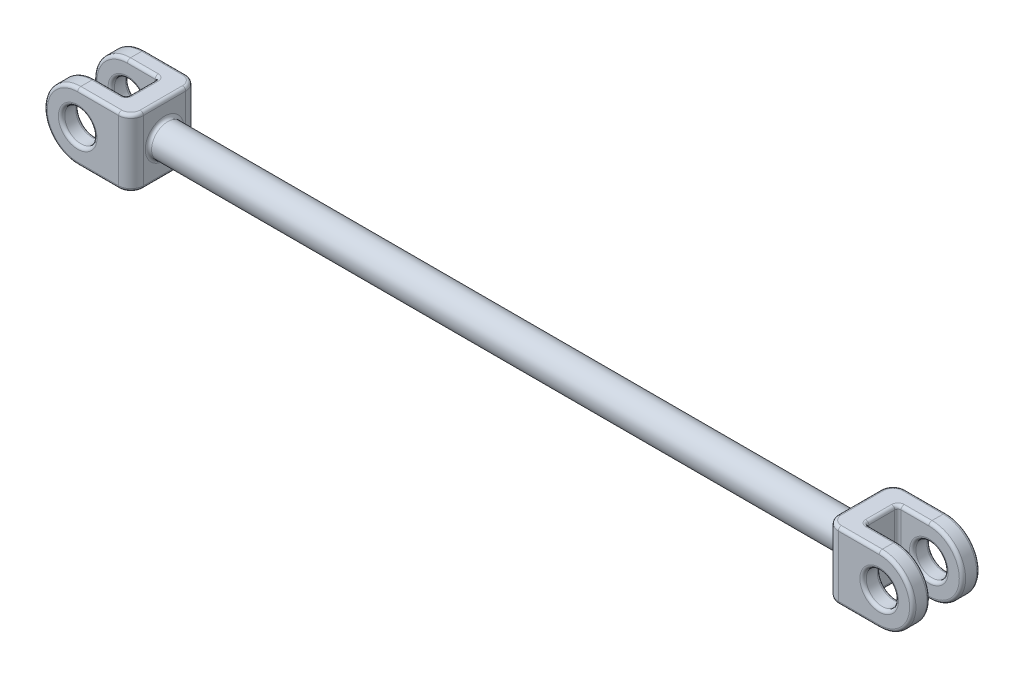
ISO-10303-21;
HEADER;
FILE_DESCRIPTION(('STEP AP214'),'2;1');
FILE_NAME('part.step','',(''),(''),'','','');
FILE_SCHEMA(('AUTOMOTIVE_DESIGN { 1 0 10303 214 1 1 1 1 }'));
ENDSEC;
DATA;
#1=APPLICATION_CONTEXT('core data for automotive mechanical design processes');
#2=APPLICATION_PROTOCOL_DEFINITION('international standard','automotive_design',2000,#1);
#3=PRODUCT_CONTEXT('',#1,'mechanical');
#4=PRODUCT('Part','Part','',(#3));
#5=PRODUCT_RELATED_PRODUCT_CATEGORY('part','',(#4));
#6=PRODUCT_DEFINITION_FORMATION('','',#4);
#7=PRODUCT_DEFINITION_CONTEXT('part definition',#1,'design');
#8=PRODUCT_DEFINITION('design','',#6,#7);
#9=PRODUCT_DEFINITION_SHAPE('','',#8);
#10=(LENGTH_UNIT() NAMED_UNIT(*) SI_UNIT(.MILLI.,.METRE.));
#11=(NAMED_UNIT(*) PLANE_ANGLE_UNIT() SI_UNIT($,.RADIAN.));
#12=(NAMED_UNIT(*) SI_UNIT($,.STERADIAN.) SOLID_ANGLE_UNIT());
#13=UNCERTAINTY_MEASURE_WITH_UNIT(LENGTH_MEASURE(1.E-05),#10,'distance_accuracy_value','');
#14=(GEOMETRIC_REPRESENTATION_CONTEXT(3) GLOBAL_UNCERTAINTY_ASSIGNED_CONTEXT((#13)) GLOBAL_UNIT_ASSIGNED_CONTEXT((#10,
#11,#12)) REPRESENTATION_CONTEXT('',''));
#15=CARTESIAN_POINT('',(0.,0.,0.));
#16=DIRECTION('',(0.,0.,1.));
#17=DIRECTION('',(1.,0.,0.));
#18=AXIS2_PLACEMENT_3D('',#15,#16,#17);
#19=CARTESIAN_POINT('',(13.6398,-8.58519999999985,8.58519999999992));
#20=DIRECTION('',(-0.999999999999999,0.,0.));
#21=DIRECTION('',(0.,0.,1.));
#22=AXIS2_PLACEMENT_3D('',#19,#20,#21);
#23=PLANE('',#22);
#24=CARTESIAN_POINT('',(13.6398,0.,0.));
#25=DIRECTION('',(-0.999999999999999,0.,0.));
#26=DIRECTION('',(0.,0.,1.));
#27=AXIS2_PLACEMENT_3D('',#24,#25,#26);
#28=CIRCLE('',#27,4.9403);
#29=CARTESIAN_POINT('',(13.6398,0.,4.94029999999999));
#30=VERTEX_POINT('',#29);
#31=EDGE_CURVE('E700',#30,#30,#28,.T.);
#32=ORIENTED_EDGE('',*,*,#31,.T.);
#33=EDGE_LOOP('',(#32));
#34=FACE_BOUND('',#33,.T.);
#35=DIRECTION('',(0.,1.,0.));
#36=VECTOR('',#35,1.);
#37=CARTESIAN_POINT('',(13.6398,-8.5851999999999,-5.41019999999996));
#38=LINE('',#37,#36);
#39=CARTESIAN_POINT('',(13.6398,-7.7723999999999,-5.4102000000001));
#40=VERTEX_POINT('',#39);
#41=CARTESIAN_POINT('',(13.6398,7.77240000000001,-5.4102));
#42=VERTEX_POINT('',#41);
#43=EDGE_CURVE('E452',#40,#42,#38,.T.);
#44=ORIENTED_EDGE('',*,*,#43,.T.);
#45=DIRECTION('',(0.,0.,-1.));
#46=VECTOR('',#45,1.);
#47=CARTESIAN_POINT('',(13.6398000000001,7.77240000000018,8.58520000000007));
#48=LINE('',#47,#46);
#49=CARTESIAN_POINT('',(13.6398,7.77240000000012,5.41020000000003));
#50=VERTEX_POINT('',#49);
#51=EDGE_CURVE('E56',#42,#50,#48,.F.);
#52=ORIENTED_EDGE('',*,*,#51,.T.);
#53=DIRECTION('',(0.,1.,0.));
#54=VECTOR('',#53,1.);
#55=CARTESIAN_POINT('',(13.6398,-8.58519999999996,5.41020000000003));
#56=LINE('',#55,#54);
#57=CARTESIAN_POINT('',(13.6398,-7.7723999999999,5.4102));
#58=VERTEX_POINT('',#57);
#59=EDGE_CURVE('E450',#50,#58,#56,.F.);
#60=ORIENTED_EDGE('',*,*,#59,.T.);
#61=DIRECTION('',(0.,0.,-1.));
#62=VECTOR('',#61,1.);
#63=CARTESIAN_POINT('',(13.6398,-7.77240000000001,8.58519999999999));
#64=LINE('',#63,#62);
#65=EDGE_CURVE('E703',#58,#40,#64,.T.);
#66=ORIENTED_EDGE('',*,*,#65,.T.);
#67=EDGE_LOOP('',(#44,#52,#60,#66));
#68=FACE_BOUND('',#67,.T.);
#69=ADVANCED_FACE('F34',(#34,#68),#23,.F.);
#70=CARTESIAN_POINT('',(0.,1.11022302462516E-13,8.5852));
#71=DIRECTION('',(0.,0.,-1.));
#72=DIRECTION('',(-0.999999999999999,0.,0.));
#73=AXIS2_PLACEMENT_3D('',#70,#71,#72);
#74=CYLINDRICAL_SURFACE('',#73,8.5852);
#75=DIRECTION('',(0.,0.,-1.));
#76=VECTOR('',#75,1.);
#77=CARTESIAN_POINT('',(0.,-8.58519999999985,8.58519999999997));
#78=LINE('',#77,#76);
#79=CARTESIAN_POINT('',(0.,-8.5851999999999,-4.94030000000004));
#80=VERTEX_POINT('',#79);
#81=CARTESIAN_POINT('',(0.,-8.58520000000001,-7.77240000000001));
#82=VERTEX_POINT('',#81);
#83=EDGE_CURVE('E434',#80,#82,#78,.T.);
#84=ORIENTED_EDGE('',*,*,#83,.F.);
#85=CARTESIAN_POINT('',(0.,1.11022302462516E-13,-4.94030000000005));
#86=DIRECTION('',(0.,0.,-1.));
#87=DIRECTION('',(-0.999999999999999,0.,0.));
#88=AXIS2_PLACEMENT_3D('',#85,#86,#87);
#89=CIRCLE('',#88,8.5852);
#90=CARTESIAN_POINT('',(0.,8.58520000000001,-4.94030000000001));
#91=VERTEX_POINT('',#90);
#92=EDGE_CURVE('E679',#80,#91,#89,.T.);
#93=ORIENTED_EDGE('',*,*,#92,.T.);
#94=DIRECTION('',(0.,0.,-1.));
#95=VECTOR('',#94,1.);
#96=CARTESIAN_POINT('',(0.,8.58520000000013,8.58520000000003));
#97=LINE('',#96,#95);
#98=CARTESIAN_POINT('',(0.,8.58520000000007,-7.7724));
#99=VERTEX_POINT('',#98);
#100=EDGE_CURVE('E430',#91,#99,#97,.T.);
#101=ORIENTED_EDGE('',*,*,#100,.T.);
#102=CARTESIAN_POINT('',(0.,0.,-7.77240000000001));
#103=DIRECTION('',(0.,0.,1.));
#104=DIRECTION('',(0.999999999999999,0.,0.));
#105=AXIS2_PLACEMENT_3D('',#102,#103,#104);
#106=CIRCLE('',#105,8.5852);
#107=EDGE_CURVE('E676',#99,#82,#106,.T.);
#108=ORIENTED_EDGE('',*,*,#107,.T.);
#109=EDGE_LOOP('',(#84,#93,#101,#108));
#110=FACE_BOUND('',#109,.T.);
#111=ADVANCED_FACE('F888',(#110),#74,.T.);
#112=CARTESIAN_POINT('',(0.,1.11022302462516E-13,8.5852));
#113=DIRECTION('',(0.,0.,-1.));
#114=DIRECTION('',(-0.999999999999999,0.,0.));
#115=AXIS2_PLACEMENT_3D('',#112,#113,#114);
#116=CYLINDRICAL_SURFACE('',#115,4.1275);
#117=CARTESIAN_POINT('',(0.,1.11022302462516E-13,-4.94030000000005));
#118=DIRECTION('',(0.,0.,-1.));
#119=DIRECTION('',(-0.999999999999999,0.,0.));
#120=AXIS2_PLACEMENT_3D('',#117,#118,#119);
#121=CIRCLE('',#120,4.1275);
#122=CARTESIAN_POINT('',(-4.12749999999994,1.10793180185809E-13,-4.94030000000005));
#123=VERTEX_POINT('',#122);
#124=EDGE_CURVE('E673',#123,#123,#121,.F.);
#125=ORIENTED_EDGE('',*,*,#124,.T.);
#126=EDGE_LOOP('',(#125));
#127=FACE_BOUND('',#126,.T.);
#128=CARTESIAN_POINT('',(0.,0.,-7.77240000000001));
#129=DIRECTION('',(0.,0.,1.));
#130=DIRECTION('',(0.999999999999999,0.,0.));
#131=AXIS2_PLACEMENT_3D('',#128,#129,#130);
#132=CIRCLE('',#131,4.1275);
#133=CARTESIAN_POINT('',(4.12750000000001,0.,-7.77240000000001));
#134=VERTEX_POINT('',#133);
#135=EDGE_CURVE('E670',#134,#134,#132,.F.);
#136=ORIENTED_EDGE('',*,*,#135,.T.);
#137=EDGE_LOOP('',(#136));
#138=FACE_BOUND('',#137,.T.);
#139=ADVANCED_FACE('F894',(#127,#138),#116,.F.);
#140=CARTESIAN_POINT('',(0.,1.11022302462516E-13,8.5852));
#141=DIRECTION('',(0.,0.,1.));
#142=DIRECTION('',(0.999999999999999,0.,0.));
#143=AXIS2_PLACEMENT_3D('',#140,#141,#142);
#144=PLANE('',#143);
#145=CARTESIAN_POINT('',(0.,1.11022302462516E-13,8.5852));
#146=DIRECTION('',(0.,0.,1.));
#147=DIRECTION('',(0.999999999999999,0.,0.));
#148=AXIS2_PLACEMENT_3D('',#145,#146,#147);
#149=CIRCLE('',#148,4.9403);
#150=CARTESIAN_POINT('',(4.94030000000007,1.11022302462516E-13,8.58520000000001));
#151=VERTEX_POINT('',#150);
#152=EDGE_CURVE('E697',#151,#151,#149,.F.);
#153=ORIENTED_EDGE('',*,*,#152,.T.);
#154=EDGE_LOOP('',(#153));
#155=FACE_BOUND('',#154,.T.);
#156=CARTESIAN_POINT('',(0.,1.11022302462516E-13,8.5852));
#157=DIRECTION('',(0.,0.,1.));
#158=DIRECTION('',(0.999999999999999,0.,0.));
#159=AXIS2_PLACEMENT_3D('',#156,#157,#158);
#160=CIRCLE('',#159,7.7724);
#161=CARTESIAN_POINT('',(0.,7.77240000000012,8.58520000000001));
#162=VERTEX_POINT('',#161);
#163=CARTESIAN_POINT('',(0.,-7.7723999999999,8.5852));
#164=VERTEX_POINT('',#163);
#165=EDGE_CURVE('E693',#162,#164,#160,.T.);
#166=ORIENTED_EDGE('',*,*,#165,.T.);
#167=DIRECTION('',(0.999999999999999,0.,0.));
#168=VECTOR('',#167,1.);
#169=CARTESIAN_POINT('',(10.4648,-7.77240000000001,8.5852));
#170=LINE('',#169,#168);
#171=CARTESIAN_POINT('',(10.4648,-7.77240000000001,8.5852));
#172=VERTEX_POINT('',#171);
#173=EDGE_CURVE('E695',#164,#172,#170,.T.);
#174=ORIENTED_EDGE('',*,*,#173,.T.);
#175=DIRECTION('',(0.,1.,0.));
#176=VECTOR('',#175,1.);
#177=CARTESIAN_POINT('',(10.4648,8.58520000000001,8.5852));
#178=LINE('',#177,#176);
#179=CARTESIAN_POINT('',(10.4648,7.77240000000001,8.58520000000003));
#180=VERTEX_POINT('',#179);
#181=EDGE_CURVE('E457',#172,#180,#178,.T.);
#182=ORIENTED_EDGE('',*,*,#181,.T.);
#183=DIRECTION('',(-0.999999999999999,0.,0.));
#184=VECTOR('',#183,1.);
#185=CARTESIAN_POINT('',(0.,7.77240000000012,8.58520000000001));
#186=LINE('',#185,#184);
#187=EDGE_CURVE('E691',#180,#162,#186,.T.);
#188=ORIENTED_EDGE('',*,*,#187,.T.);
#189=EDGE_LOOP('',(#166,#174,#182,#188));
#190=FACE_BOUND('',#189,.T.);
#191=ADVANCED_FACE('F999',(#155,#190),#144,.T.);
#192=CARTESIAN_POINT('',(0.,0.,-8.58520000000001));
#193=DIRECTION('',(0.,0.,1.));
#194=DIRECTION('',(0.999999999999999,0.,0.));
#195=AXIS2_PLACEMENT_3D('',#192,#193,#194);
#196=PLANE('',#195);
#197=CARTESIAN_POINT('',(0.,0.,-8.58520000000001));
#198=DIRECTION('',(0.,0.,1.));
#199=DIRECTION('',(0.999999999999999,0.,0.));
#200=AXIS2_PLACEMENT_3D('',#197,#198,#199);
#201=CIRCLE('',#200,4.9403);
#202=CARTESIAN_POINT('',(4.9403,0.,-8.58520000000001));
#203=VERTEX_POINT('',#202);
#204=EDGE_CURVE('E688',#203,#203,#201,.T.);
#205=ORIENTED_EDGE('',*,*,#204,.T.);
#206=EDGE_LOOP('',(#205));
#207=FACE_BOUND('',#206,.T.);
#208=DIRECTION('',(0.,1.,0.));
#209=VECTOR('',#208,1.);
#210=CARTESIAN_POINT('',(10.4648,0.,-8.5852));
#211=LINE('',#210,#209);
#212=CARTESIAN_POINT('',(10.4648,7.77240000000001,-8.58519999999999));
#213=VERTEX_POINT('',#212);
#214=CARTESIAN_POINT('',(10.4648,-7.77240000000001,-8.58520000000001));
#215=VERTEX_POINT('',#214);
#216=EDGE_CURVE('E454',#213,#215,#211,.F.);
#217=ORIENTED_EDGE('',*,*,#216,.T.);
#218=DIRECTION('',(0.999999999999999,0.,0.));
#219=VECTOR('',#218,1.);
#220=CARTESIAN_POINT('',(0.,-7.77240000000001,-8.58520000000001));
#221=LINE('',#220,#219);
#222=CARTESIAN_POINT('',(0.,-7.77240000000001,-8.58520000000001));
#223=VERTEX_POINT('',#222);
#224=EDGE_CURVE('E686',#215,#223,#221,.F.);
#225=ORIENTED_EDGE('',*,*,#224,.T.);
#226=CARTESIAN_POINT('',(0.,0.,-8.58520000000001));
#227=DIRECTION('',(0.,0.,1.));
#228=DIRECTION('',(0.999999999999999,0.,0.));
#229=AXIS2_PLACEMENT_3D('',#226,#227,#228);
#230=CIRCLE('',#229,7.7724);
#231=CARTESIAN_POINT('',(0.,7.77240000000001,-8.58519999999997));
#232=VERTEX_POINT('',#231);
#233=EDGE_CURVE('E683',#223,#232,#230,.F.);
#234=ORIENTED_EDGE('',*,*,#233,.T.);
#235=DIRECTION('',(-0.999999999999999,0.,0.));
#236=VECTOR('',#235,1.);
#237=CARTESIAN_POINT('',(0.,7.77240000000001,-8.58519999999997));
#238=LINE('',#237,#236);
#239=EDGE_CURVE('E681',#232,#213,#238,.F.);
#240=ORIENTED_EDGE('',*,*,#239,.T.);
#241=EDGE_LOOP('',(#217,#225,#234,#240));
#242=FACE_BOUND('',#241,.T.);
#243=ADVANCED_FACE('F727',(#207,#242),#196,.F.);
#244=CARTESIAN_POINT('',(0.,8.58520000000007,7.77240000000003));
#245=VERTEX_POINT('',#244);
#246=CARTESIAN_POINT('',(0.,8.58520000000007,4.94030000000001));
#247=VERTEX_POINT('',#246);
#248=EDGE_CURVE('E431',#245,#247,#97,.T.);
#249=ORIENTED_EDGE('',*,*,#248,.T.);
#250=CARTESIAN_POINT('',(0.,0.,4.94029999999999));
#251=DIRECTION('',(0.,0.,1.));
#252=DIRECTION('',(0.999999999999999,0.,0.));
#253=AXIS2_PLACEMENT_3D('',#250,#251,#252);
#254=CIRCLE('',#253,8.5852);
#255=CARTESIAN_POINT('',(0.,-8.58519999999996,4.94029999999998));
#256=VERTEX_POINT('',#255);
#257=EDGE_CURVE('E668',#247,#256,#254,.T.);
#258=ORIENTED_EDGE('',*,*,#257,.T.);
#259=CARTESIAN_POINT('',(0.,-8.58519999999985,7.77239999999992));
#260=VERTEX_POINT('',#259);
#261=EDGE_CURVE('E437',#260,#256,#78,.T.);
#262=ORIENTED_EDGE('',*,*,#261,.F.);
#263=CARTESIAN_POINT('',(0.,1.11022302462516E-13,7.77240000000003));
#264=DIRECTION('',(0.,0.,1.));
#265=DIRECTION('',(0.999999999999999,0.,0.));
#266=AXIS2_PLACEMENT_3D('',#263,#264,#265);
#267=CIRCLE('',#266,8.5852);
#268=EDGE_CURVE('E666',#260,#245,#267,.F.);
#269=ORIENTED_EDGE('',*,*,#268,.T.);
#270=EDGE_LOOP('',(#249,#258,#262,#269));
#271=FACE_BOUND('',#270,.T.);
#272=ADVANCED_FACE('F36',(#271),#74,.T.);
#273=CARTESIAN_POINT('',(0.,-8.58519999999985,8.58519999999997));
#274=DIRECTION('',(0.,1.,0.));
#275=DIRECTION('',(0.,0.,1.));
#276=AXIS2_PLACEMENT_3D('',#273,#274,#275);
#277=PLANE('',#276);
#278=CARTESIAN_POINT('',(7.11199999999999,-8.58519999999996,-3.31469999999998));
#279=DIRECTION('',(0.,1.,0.));
#280=DIRECTION('',(0.,0.,1.));
#281=AXIS2_PLACEMENT_3D('',#278,#279,#280);
#282=CIRCLE('',#281,1.6256);
#283=CARTESIAN_POINT('',(7.11200000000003,-8.5851999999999,-4.94030000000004));
#284=VERTEX_POINT('',#283);
#285=CARTESIAN_POINT('',(8.73759999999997,-8.58519999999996,-3.31470000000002));
#286=VERTEX_POINT('',#285);
#287=EDGE_CURVE('E648',#284,#286,#282,.F.);
#288=ORIENTED_EDGE('',*,*,#287,.F.);
#289=DIRECTION('',(-0.999999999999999,0.,0.));
#290=VECTOR('',#289,1.);
#291=CARTESIAN_POINT('',(0.,-8.5851999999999,-4.94030000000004));
#292=LINE('',#291,#290);
#293=EDGE_CURVE('E658',#284,#80,#292,.T.);
#294=ORIENTED_EDGE('',*,*,#293,.T.);
#295=ORIENTED_EDGE('',*,*,#83,.T.);
#296=DIRECTION('',(0.999999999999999,0.,0.));
#297=VECTOR('',#296,1.);
#298=CARTESIAN_POINT('',(0.,-8.58520000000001,-7.77240000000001));
#299=LINE('',#298,#297);
#300=CARTESIAN_POINT('',(10.4648,-8.58519999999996,-7.77240000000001));
#301=VERTEX_POINT('',#300);
#302=EDGE_CURVE('E642',#82,#301,#299,.T.);
#303=ORIENTED_EDGE('',*,*,#302,.T.);
#304=CARTESIAN_POINT('',(10.4648,-8.58519999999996,-5.41020000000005));
#305=DIRECTION('',(0.,1.,0.));
#306=DIRECTION('',(0.,0.,1.));
#307=AXIS2_PLACEMENT_3D('',#304,#305,#306);
#308=CIRCLE('',#307,2.3622);
#309=CARTESIAN_POINT('',(12.827,-8.58520000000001,-5.41020000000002));
#310=VERTEX_POINT('',#309);
#311=EDGE_CURVE('E638',#301,#310,#308,.F.);
#312=ORIENTED_EDGE('',*,*,#311,.T.);
#313=DIRECTION('',(0.,0.,-1.));
#314=VECTOR('',#313,1.);
#315=CARTESIAN_POINT('',(12.827,-8.58519999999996,8.5852));
#316=LINE('',#315,#314);
#317=CARTESIAN_POINT('',(12.827,-8.58519999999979,5.41019999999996));
#318=VERTEX_POINT('',#317);
#319=EDGE_CURVE('E640',#310,#318,#316,.F.);
#320=ORIENTED_EDGE('',*,*,#319,.T.);
#321=CARTESIAN_POINT('',(10.4648,-8.58519999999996,5.41019999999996));
#322=DIRECTION('',(0.,1.,0.));
#323=DIRECTION('',(0.,0.,1.));
#324=AXIS2_PLACEMENT_3D('',#321,#322,#323);
#325=CIRCLE('',#324,2.3622);
#326=CARTESIAN_POINT('',(10.4648,-8.58519999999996,7.77239999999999));
#327=VERTEX_POINT('',#326);
#328=EDGE_CURVE('E644',#318,#327,#325,.F.);
#329=ORIENTED_EDGE('',*,*,#328,.T.);
#330=DIRECTION('',(0.999999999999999,0.,0.));
#331=VECTOR('',#330,1.);
#332=CARTESIAN_POINT('',(0.,-8.58519999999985,7.77239999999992));
#333=LINE('',#332,#331);
#334=EDGE_CURVE('E646',#327,#260,#333,.F.);
#335=ORIENTED_EDGE('',*,*,#334,.T.);
#336=ORIENTED_EDGE('',*,*,#261,.T.);
#337=DIRECTION('',(0.999999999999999,0.,0.));
#338=VECTOR('',#337,1.);
#339=CARTESIAN_POINT('',(0.,-8.58519999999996,4.94029999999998));
#340=LINE('',#339,#338);
#341=CARTESIAN_POINT('',(7.11200000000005,-8.58519999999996,4.94030000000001));
#342=VERTEX_POINT('',#341);
#343=EDGE_CURVE('E656',#256,#342,#340,.T.);
#344=ORIENTED_EDGE('',*,*,#343,.T.);
#345=CARTESIAN_POINT('',(7.11200000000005,-8.58519999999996,3.31469999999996));
#346=DIRECTION('',(0.,1.,0.));
#347=DIRECTION('',(0.,0.,1.));
#348=AXIS2_PLACEMENT_3D('',#345,#346,#347);
#349=CIRCLE('',#348,1.6256);
#350=CARTESIAN_POINT('',(8.73760000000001,-8.5851999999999,3.31469999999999));
#351=VERTEX_POINT('',#350);
#352=EDGE_CURVE('E653',#351,#342,#349,.F.);
#353=ORIENTED_EDGE('',*,*,#352,.F.);
#354=DIRECTION('',(0.,0.,-1.));
#355=VECTOR('',#354,1.);
#356=CARTESIAN_POINT('',(8.73760000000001,-8.58520000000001,8.58519999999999));
#357=LINE('',#356,#355);
#358=EDGE_CURVE('E651',#351,#286,#357,.T.);
#359=ORIENTED_EDGE('',*,*,#358,.T.);
#360=EDGE_LOOP('',(#288,#294,#295,#303,#312,#320,#329,#335,#336,#344,#353,#359));
#361=FACE_BOUND('',#360,.T.);
#362=ADVANCED_FACE('F899',(#361),#277,.F.);
#363=CARTESIAN_POINT('',(13.6398,8.58520000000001,8.5852));
#364=DIRECTION('',(0.,-1.,0.));
#365=DIRECTION('',(0.,0.,-1.));
#366=AXIS2_PLACEMENT_3D('',#363,#364,#365);
#367=PLANE('',#366);
#368=ORIENTED_EDGE('',*,*,#100,.F.);
#369=DIRECTION('',(-0.999999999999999,0.,0.));
#370=VECTOR('',#369,1.);
#371=CARTESIAN_POINT('',(13.6398,8.58520000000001,-4.94030000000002));
#372=LINE('',#371,#370);
#373=CARTESIAN_POINT('',(7.11200000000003,8.58520000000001,-4.94029999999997));
#374=VERTEX_POINT('',#373);
#375=EDGE_CURVE('E614',#91,#374,#372,.F.);
#376=ORIENTED_EDGE('',*,*,#375,.T.);
#377=CARTESIAN_POINT('',(7.11199999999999,8.58520000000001,-3.3147));
#378=DIRECTION('',(0.,-1.,0.));
#379=DIRECTION('',(0.,0.,-1.));
#380=AXIS2_PLACEMENT_3D('',#377,#378,#379);
#381=CIRCLE('',#380,1.6256);
#382=CARTESIAN_POINT('',(8.73759999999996,8.58520000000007,-3.31469999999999));
#383=VERTEX_POINT('',#382);
#384=EDGE_CURVE('E611',#383,#374,#381,.F.);
#385=ORIENTED_EDGE('',*,*,#384,.F.);
#386=DIRECTION('',(0.,0.,-1.));
#387=VECTOR('',#386,1.);
#388=CARTESIAN_POINT('',(8.73760000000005,8.58520000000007,8.58520000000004));
#389=LINE('',#388,#387);
#390=CARTESIAN_POINT('',(8.73760000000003,8.58520000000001,3.31470000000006));
#391=VERTEX_POINT('',#390);
#392=EDGE_CURVE('E607',#383,#391,#389,.F.);
#393=ORIENTED_EDGE('',*,*,#392,.T.);
#394=CARTESIAN_POINT('',(7.11200000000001,8.58520000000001,3.31470000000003));
#395=DIRECTION('',(0.,-1.,0.));
#396=DIRECTION('',(0.,0.,-1.));
#397=AXIS2_PLACEMENT_3D('',#394,#395,#396);
#398=CIRCLE('',#397,1.6256);
#399=CARTESIAN_POINT('',(7.11200000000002,8.58520000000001,4.94030000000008));
#400=VERTEX_POINT('',#399);
#401=EDGE_CURVE('E604',#400,#391,#398,.F.);
#402=ORIENTED_EDGE('',*,*,#401,.F.);
#403=DIRECTION('',(0.999999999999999,0.,0.));
#404=VECTOR('',#403,1.);
#405=CARTESIAN_POINT('',(13.6398000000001,8.58520000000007,4.94030000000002));
#406=LINE('',#405,#404);
#407=EDGE_CURVE('E609',#400,#247,#406,.F.);
#408=ORIENTED_EDGE('',*,*,#407,.T.);
#409=ORIENTED_EDGE('',*,*,#248,.F.);
#410=DIRECTION('',(-0.999999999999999,0.,0.));
#411=VECTOR('',#410,1.);
#412=CARTESIAN_POINT('',(10.4648,8.58520000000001,7.77240000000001));
#413=LINE('',#412,#411);
#414=CARTESIAN_POINT('',(10.4648,8.58520000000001,7.77240000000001));
#415=VERTEX_POINT('',#414);
#416=EDGE_CURVE('E602',#245,#415,#413,.F.);
#417=ORIENTED_EDGE('',*,*,#416,.T.);
#418=CARTESIAN_POINT('',(10.4648000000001,8.58520000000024,5.41020000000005));
#419=DIRECTION('',(0.,-1.,0.));
#420=DIRECTION('',(0.,0.,-1.));
#421=AXIS2_PLACEMENT_3D('',#418,#419,#420);
#422=CIRCLE('',#421,2.3622);
#423=CARTESIAN_POINT('',(12.827,8.58520000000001,5.41020000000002));
#424=VERTEX_POINT('',#423);
#425=EDGE_CURVE('E600',#415,#424,#422,.F.);
#426=ORIENTED_EDGE('',*,*,#425,.T.);
#427=DIRECTION('',(0.,0.,-1.));
#428=VECTOR('',#427,1.);
#429=CARTESIAN_POINT('',(12.827,8.58520000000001,8.5852));
#430=LINE('',#429,#428);
#431=CARTESIAN_POINT('',(12.827,8.58520000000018,-5.41019999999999));
#432=VERTEX_POINT('',#431);
#433=EDGE_CURVE('E596',#424,#432,#430,.T.);
#434=ORIENTED_EDGE('',*,*,#433,.T.);
#435=CARTESIAN_POINT('',(10.4648,8.58520000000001,-5.41019999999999));
#436=DIRECTION('',(0.,-1.,0.));
#437=DIRECTION('',(0.,0.,-1.));
#438=AXIS2_PLACEMENT_3D('',#435,#436,#437);
#439=CIRCLE('',#438,2.3622);
#440=CARTESIAN_POINT('',(10.4648,8.58520000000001,-7.7724));
#441=VERTEX_POINT('',#440);
#442=EDGE_CURVE('E594',#432,#441,#439,.F.);
#443=ORIENTED_EDGE('',*,*,#442,.T.);
#444=DIRECTION('',(-0.999999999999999,0.,0.));
#445=VECTOR('',#444,1.);
#446=CARTESIAN_POINT('',(13.6398,8.58520000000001,-7.7724));
#447=LINE('',#446,#445);
#448=EDGE_CURVE('E598',#441,#99,#447,.T.);
#449=ORIENTED_EDGE('',*,*,#448,.T.);
#450=EDGE_LOOP('',(#368,#376,#385,#393,#402,#408,#409,#417,#426,#434,#443,#449));
#451=FACE_BOUND('',#450,.T.);
#452=ADVANCED_FACE('F897',(#451),#367,.F.);
#453=CARTESIAN_POINT('',(0.,0.,4.94029999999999));
#454=DIRECTION('',(0.,0.,1.));
#455=DIRECTION('',(0.999999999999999,0.,0.));
#456=AXIS2_PLACEMENT_3D('',#453,#454,#455);
#457=CIRCLE('',#456,4.1275);
#458=CARTESIAN_POINT('',(4.12749999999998,0.,4.9403));
#459=VERTEX_POINT('',#458);
#460=EDGE_CURVE('E663',#459,#459,#457,.F.);
#461=ORIENTED_EDGE('',*,*,#460,.T.);
#462=EDGE_LOOP('',(#461));
#463=FACE_BOUND('',#462,.T.);
#464=CARTESIAN_POINT('',(0.,1.11022302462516E-13,7.77240000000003));
#465=DIRECTION('',(0.,0.,1.));
#466=DIRECTION('',(0.999999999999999,0.,0.));
#467=AXIS2_PLACEMENT_3D('',#464,#465,#466);
#468=CIRCLE('',#467,4.1275);
#469=CARTESIAN_POINT('',(4.12749999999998,1.11022302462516E-13,7.77240000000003));
#470=VERTEX_POINT('',#469);
#471=EDGE_CURVE('E660',#470,#470,#468,.T.);
#472=ORIENTED_EDGE('',*,*,#471,.T.);
#473=EDGE_LOOP('',(#472));
#474=FACE_BOUND('',#473,.T.);
#475=ADVANCED_FACE('F906',(#463,#474),#116,.F.);
#476=CARTESIAN_POINT('',(-8.5852,-8.58520000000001,-4.12750000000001));
#477=DIRECTION('',(0.,0.,-1.));
#478=DIRECTION('',(-0.999999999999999,0.,0.));
#479=AXIS2_PLACEMENT_3D('',#476,#477,#478);
#480=PLANE('',#479);
#481=CARTESIAN_POINT('',(0.,0.,-4.12749999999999));
#482=DIRECTION('',(0.,0.,-1.));
#483=DIRECTION('',(-0.999999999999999,0.,0.));
#484=AXIS2_PLACEMENT_3D('',#481,#482,#483);
#485=CIRCLE('',#484,4.9403);
#486=CARTESIAN_POINT('',(-4.94029999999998,0.,-4.1275));
#487=VERTEX_POINT('',#486);
#488=EDGE_CURVE('E591',#487,#487,#485,.T.);
#489=ORIENTED_EDGE('',*,*,#488,.T.);
#490=EDGE_LOOP('',(#489));
#491=FACE_BOUND('',#490,.T.);
#492=DIRECTION('',(-0.999999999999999,0.,0.));
#493=VECTOR('',#492,1.);
#494=CARTESIAN_POINT('',(-8.58519999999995,-7.77239999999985,-4.12749999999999));
#495=LINE('',#494,#493);
#496=CARTESIAN_POINT('',(0.,-7.77240000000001,-4.12750000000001));
#497=VERTEX_POINT('',#496);
#498=CARTESIAN_POINT('',(7.11200000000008,-7.77240000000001,-4.12750000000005));
#499=VERTEX_POINT('',#498);
#500=EDGE_CURVE('E584',#497,#499,#495,.F.);
#501=ORIENTED_EDGE('',*,*,#500,.T.);
#502=DIRECTION('',(0.,1.,0.));
#503=VECTOR('',#502,1.);
#504=CARTESIAN_POINT('',(7.11200000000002,8.58520000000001,-4.12749999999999));
#505=LINE('',#504,#503);
#506=CARTESIAN_POINT('',(7.11200000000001,7.77240000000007,-4.12750000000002));
#507=VERTEX_POINT('',#506);
#508=EDGE_CURVE('E589',#499,#507,#505,.T.);
#509=ORIENTED_EDGE('',*,*,#508,.T.);
#510=DIRECTION('',(-0.999999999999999,0.,0.));
#511=VECTOR('',#510,1.);
#512=CARTESIAN_POINT('',(-8.58519999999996,7.77240000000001,-4.12749999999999));
#513=LINE('',#512,#511);
#514=CARTESIAN_POINT('',(0.,7.77240000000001,-4.12749999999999));
#515=VERTEX_POINT('',#514);
#516=EDGE_CURVE('E586',#507,#515,#513,.T.);
#517=ORIENTED_EDGE('',*,*,#516,.T.);
#518=CARTESIAN_POINT('',(0.,0.,-4.12749999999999));
#519=DIRECTION('',(0.,0.,-1.));
#520=DIRECTION('',(-0.999999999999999,0.,0.));
#521=AXIS2_PLACEMENT_3D('',#518,#519,#520);
#522=CIRCLE('',#521,7.7724);
#523=EDGE_CURVE('E582',#515,#497,#522,.F.);
#524=ORIENTED_EDGE('',*,*,#523,.T.);
#525=EDGE_LOOP('',(#501,#509,#517,#524));
#526=FACE_BOUND('',#525,.T.);
#527=ADVANCED_FACE('F982',(#491,#526),#480,.F.);
#528=CARTESIAN_POINT('',(-8.58519999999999,-8.58519999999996,4.12749999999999));
#529=DIRECTION('',(0.,0.,1.));
#530=DIRECTION('',(0.999999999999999,0.,0.));
#531=AXIS2_PLACEMENT_3D('',#528,#529,#530);
#532=PLANE('',#531);
#533=CARTESIAN_POINT('',(0.,1.11022302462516E-13,4.12749999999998));
#534=DIRECTION('',(0.,0.,1.));
#535=DIRECTION('',(0.999999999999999,0.,0.));
#536=AXIS2_PLACEMENT_3D('',#533,#534,#535);
#537=CIRCLE('',#536,4.9403);
#538=CARTESIAN_POINT('',(4.94029999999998,1.11022302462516E-13,4.12749999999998));
#539=VERTEX_POINT('',#538);
#540=EDGE_CURVE('E626',#539,#539,#537,.T.);
#541=ORIENTED_EDGE('',*,*,#540,.T.);
#542=EDGE_LOOP('',(#541));
#543=FACE_BOUND('',#542,.T.);
#544=DIRECTION('',(0.999999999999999,0.,0.));
#545=VECTOR('',#544,1.);
#546=CARTESIAN_POINT('',(-8.58519999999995,7.77240000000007,4.12750000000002));
#547=LINE('',#546,#545);
#548=CARTESIAN_POINT('',(0.,7.77240000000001,4.12750000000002));
#549=VERTEX_POINT('',#548);
#550=CARTESIAN_POINT('',(7.11199999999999,7.77240000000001,4.12749999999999));
#551=VERTEX_POINT('',#550);
#552=EDGE_CURVE('E621',#549,#551,#547,.T.);
#553=ORIENTED_EDGE('',*,*,#552,.T.);
#554=DIRECTION('',(0.,1.,0.));
#555=VECTOR('',#554,1.);
#556=CARTESIAN_POINT('',(7.11200000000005,-8.5851999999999,4.12749999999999));
#557=LINE('',#556,#555);
#558=CARTESIAN_POINT('',(7.11199999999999,-7.77240000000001,4.12749999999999));
#559=VERTEX_POINT('',#558);
#560=EDGE_CURVE('E624',#551,#559,#557,.F.);
#561=ORIENTED_EDGE('',*,*,#560,.T.);
#562=DIRECTION('',(0.999999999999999,0.,0.));
#563=VECTOR('',#562,1.);
#564=CARTESIAN_POINT('',(-8.58519999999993,-7.77239999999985,4.12749999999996));
#565=LINE('',#564,#563);
#566=CARTESIAN_POINT('',(0.,-7.7723999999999,4.12749999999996));
#567=VERTEX_POINT('',#566);
#568=EDGE_CURVE('E619',#559,#567,#565,.F.);
#569=ORIENTED_EDGE('',*,*,#568,.T.);
#570=CARTESIAN_POINT('',(0.,1.11022302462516E-13,4.12749999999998));
#571=DIRECTION('',(0.,0.,1.));
#572=DIRECTION('',(0.999999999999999,0.,0.));
#573=AXIS2_PLACEMENT_3D('',#570,#571,#572);
#574=CIRCLE('',#573,7.7724);
#575=EDGE_CURVE('E617',#567,#549,#574,.F.);
#576=ORIENTED_EDGE('',*,*,#575,.T.);
#577=EDGE_LOOP('',(#553,#561,#569,#576));
#578=FACE_BOUND('',#577,.T.);
#579=ADVANCED_FACE('F984',(#543,#578),#532,.F.);
#580=CARTESIAN_POINT('',(7.92480000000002,-8.58519999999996,-4.12750000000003));
#581=DIRECTION('',(1.,0.,0.));
#582=DIRECTION('',(0.,1.,0.));
#583=AXIS2_PLACEMENT_3D('',#580,#581,#582);
#584=PLANE('',#583);
#585=DIRECTION('',(0.,0.,-1.));
#586=VECTOR('',#585,1.);
#587=CARTESIAN_POINT('',(7.92480000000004,-7.77240000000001,-4.12750000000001));
#588=LINE('',#587,#586);
#589=CARTESIAN_POINT('',(7.9248,-7.77240000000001,-3.31470000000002));
#590=VERTEX_POINT('',#589);
#591=CARTESIAN_POINT('',(7.9248,-7.77239999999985,3.31470000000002));
#592=VERTEX_POINT('',#591);
#593=EDGE_CURVE('E631',#590,#592,#588,.F.);
#594=ORIENTED_EDGE('',*,*,#593,.T.);
#595=DIRECTION('',(0.,1.,0.));
#596=VECTOR('',#595,1.);
#597=CARTESIAN_POINT('',(7.92479999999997,8.58520000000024,3.31470000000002));
#598=LINE('',#597,#596);
#599=CARTESIAN_POINT('',(7.92480000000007,7.77240000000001,3.31470000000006));
#600=VERTEX_POINT('',#599);
#601=EDGE_CURVE('E636',#592,#600,#598,.T.);
#602=ORIENTED_EDGE('',*,*,#601,.T.);
#603=DIRECTION('',(0.,0.,-1.));
#604=VECTOR('',#603,1.);
#605=CARTESIAN_POINT('',(7.9248,7.77240000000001,-4.12749999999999));
#606=LINE('',#605,#604);
#607=CARTESIAN_POINT('',(7.92480000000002,7.77240000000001,-3.31469999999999));
#608=VERTEX_POINT('',#607);
#609=EDGE_CURVE('E633',#600,#608,#606,.T.);
#610=ORIENTED_EDGE('',*,*,#609,.T.);
#611=DIRECTION('',(0.,1.,0.));
#612=VECTOR('',#611,1.);
#613=CARTESIAN_POINT('',(7.92479999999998,-8.58519999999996,-3.3147));
#614=LINE('',#613,#612);
#615=EDGE_CURVE('E629',#608,#590,#614,.F.);
#616=ORIENTED_EDGE('',*,*,#615,.T.);
#617=EDGE_LOOP('',(#594,#602,#610,#616));
#618=FACE_BOUND('',#617,.T.);
#619=ADVANCED_FACE('F991',(#618),#584,.F.);
#620=CARTESIAN_POINT('',(102.5398,1.11022302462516E-13,0.));
#621=DIRECTION('',(-0.999999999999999,0.,0.));
#622=DIRECTION('',(0.,0.,1.));
#623=AXIS2_PLACEMENT_3D('',#620,#621,#622);
#624=CYLINDRICAL_SURFACE('',#623,4.1275);
#625=CARTESIAN_POINT('',(190.627,0.,1.11022302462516E-13));
#626=DIRECTION('',(0.999999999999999,0.,0.));
#627=DIRECTION('',(0.,0.,-1.));
#628=AXIS2_PLACEMENT_3D('',#625,#626,#627);
#629=CIRCLE('',#628,4.1275);
#630=CARTESIAN_POINT('',(190.627,1.13886330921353E-13,4.12750000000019));
#631=VERTEX_POINT('',#630);
#632=EDGE_CURVE('E579',#631,#631,#629,.F.);
#633=CARTESIAN_POINT('',(14.4526,0.,0.));
#634=DIRECTION('',(-0.999999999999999,0.,0.));
#635=DIRECTION('',(0.,0.,1.));
#636=AXIS2_PLACEMENT_3D('',#633,#634,#635);
#637=CIRCLE('',#636,4.1275);
#638=CARTESIAN_POINT('',(14.4526,1.13886330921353E-13,4.12749999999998));
#639=VERTEX_POINT('',#638);
#640=EDGE_CURVE('E576',#639,#639,#637,.F.);
#641=CARTESIAN_POINT('',(190.627,1.13886330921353E-13,4.12750000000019));
#642=CARTESIAN_POINT('',(188.79185,1.13886330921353E-13,4.12750000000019));
#643=CARTESIAN_POINT('',(186.9567,1.13886330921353E-13,4.12750000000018));
#644=CARTESIAN_POINT('',(183.2864,1.13886330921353E-13,4.12750000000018));
#645=CARTESIAN_POINT('',(181.45125,1.13886330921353E-13,4.12750000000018));
#646=CARTESIAN_POINT('',(177.78095,1.13886330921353E-13,4.12750000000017));
#647=CARTESIAN_POINT('',(175.9458,1.13886330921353E-13,4.12750000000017));
#648=CARTESIAN_POINT('',(172.2755,1.13886330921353E-13,4.12750000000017));
#649=CARTESIAN_POINT('',(170.44035,1.13886330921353E-13,4.12750000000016));
#650=CARTESIAN_POINT('',(166.77005,1.13886330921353E-13,4.12750000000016));
#651=CARTESIAN_POINT('',(164.9349,1.13886330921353E-13,4.12750000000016));
#652=CARTESIAN_POINT('',(161.2646,1.13886330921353E-13,4.12750000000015));
#653=CARTESIAN_POINT('',(159.42945,1.13886330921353E-13,4.12750000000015));
#654=CARTESIAN_POINT('',(155.75915,1.13886330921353E-13,4.12750000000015));
#655=CARTESIAN_POINT('',(153.924,1.13886330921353E-13,4.12750000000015));
#656=CARTESIAN_POINT('',(150.2537,1.13886330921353E-13,4.12750000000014));
#657=CARTESIAN_POINT('',(148.41855,1.13886330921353E-13,4.12750000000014));
#658=CARTESIAN_POINT('',(144.74825,1.13886330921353E-13,4.12750000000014));
#659=CARTESIAN_POINT('',(142.9131,1.13886330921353E-13,4.12750000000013));
#660=CARTESIAN_POINT('',(139.2428,1.13886330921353E-13,4.12750000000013));
#661=CARTESIAN_POINT('',(137.40765,1.13886330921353E-13,4.12750000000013));
#662=CARTESIAN_POINT('',(133.73735,1.13886330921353E-13,4.12750000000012));
#663=CARTESIAN_POINT('',(131.9022,1.13886330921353E-13,4.12750000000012));
#664=CARTESIAN_POINT('',(128.2319,1.13886330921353E-13,4.12750000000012));
#665=CARTESIAN_POINT('',(126.39675,1.13886330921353E-13,4.12750000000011));
#666=CARTESIAN_POINT('',(122.72645,1.13886330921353E-13,4.12750000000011));
#667=CARTESIAN_POINT('',(120.8913,1.13886330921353E-13,4.12750000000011));
#668=CARTESIAN_POINT('',(117.221,1.13886330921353E-13,4.1275000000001));
#669=CARTESIAN_POINT('',(115.38585,1.13886330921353E-13,4.1275000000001));
#670=CARTESIAN_POINT('',(111.71555,1.13886330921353E-13,4.1275000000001));
#671=CARTESIAN_POINT('',(109.8804,1.13886330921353E-13,4.12750000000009));
#672=CARTESIAN_POINT('',(106.2101,1.13886330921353E-13,4.12750000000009));
#673=CARTESIAN_POINT('',(104.37495,1.13886330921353E-13,4.12750000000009));
#674=CARTESIAN_POINT('',(100.70465,1.13886330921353E-13,4.12750000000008));
#675=CARTESIAN_POINT('',(98.8694999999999,1.13886330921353E-13,4.12750000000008));
#676=CARTESIAN_POINT('',(95.1991999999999,1.13886330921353E-13,4.12750000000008));
#677=CARTESIAN_POINT('',(93.3640499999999,1.13886330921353E-13,4.12750000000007));
#678=CARTESIAN_POINT('',(89.6937499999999,1.13886330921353E-13,4.12750000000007));
#679=CARTESIAN_POINT('',(87.8585999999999,1.13886330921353E-13,4.12750000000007));
#680=CARTESIAN_POINT('',(84.1882999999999,1.13886330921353E-13,4.12750000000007));
#681=CARTESIAN_POINT('',(82.3531499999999,1.13886330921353E-13,4.12750000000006));
#682=CARTESIAN_POINT('',(78.6828499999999,1.13886330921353E-13,4.12750000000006));
#683=CARTESIAN_POINT('',(76.8476999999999,1.13886330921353E-13,4.12750000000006));
#684=CARTESIAN_POINT('',(73.1773999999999,1.13886330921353E-13,4.12750000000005));
#685=CARTESIAN_POINT('',(71.3422499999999,1.13886330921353E-13,4.12750000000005));
#686=CARTESIAN_POINT('',(67.6719499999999,1.13886330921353E-13,4.12750000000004));
#687=CARTESIAN_POINT('',(65.8367999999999,1.13886330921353E-13,4.12750000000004));
#688=CARTESIAN_POINT('',(62.1664999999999,1.13886330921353E-13,4.12750000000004));
#689=CARTESIAN_POINT('',(60.3313499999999,1.13886330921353E-13,4.12750000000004));
#690=CARTESIAN_POINT('',(56.6610499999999,1.13886330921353E-13,4.12750000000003));
#691=CARTESIAN_POINT('',(54.8258999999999,1.13886330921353E-13,4.12750000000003));
#692=CARTESIAN_POINT('',(51.1556,1.13886330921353E-13,4.12750000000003));
#693=CARTESIAN_POINT('',(49.32045,1.13886330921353E-13,4.12750000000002));
#694=CARTESIAN_POINT('',(45.65015,1.13886330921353E-13,4.12750000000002));
#695=CARTESIAN_POINT('',(43.815,1.13886330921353E-13,4.12750000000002));
#696=CARTESIAN_POINT('',(40.1447,1.13886330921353E-13,4.12750000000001));
#697=CARTESIAN_POINT('',(38.30955,1.13886330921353E-13,4.12750000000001));
#698=CARTESIAN_POINT('',(34.63925,1.13886330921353E-13,4.12750000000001));
#699=CARTESIAN_POINT('',(32.8041,1.13886330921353E-13,4.1275));
#700=CARTESIAN_POINT('',(29.1338,1.13886330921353E-13,4.1275));
#701=CARTESIAN_POINT('',(27.29865,1.13886330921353E-13,4.1275));
#702=CARTESIAN_POINT('',(23.62835,1.13886330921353E-13,4.12749999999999));
#703=CARTESIAN_POINT('',(21.7932,1.13886330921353E-13,4.12749999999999));
#704=CARTESIAN_POINT('',(18.1229,1.13886330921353E-13,4.12749999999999));
#705=CARTESIAN_POINT('',(16.28775,1.13886330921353E-13,4.12749999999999));
#706=CARTESIAN_POINT('',(14.4526,1.13886330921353E-13,4.12749999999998));
#707=B_SPLINE_CURVE_WITH_KNOTS('',3,(#641,#642,#643,#644,#645,#646,#647,#648,#649,#650,#651,
#652,#653,#654,#655,#656,#657,#658,#659,#660,#661,#662,#663,#664,#665,#666,#667,#668,#669,#670,
#671,#672,#673,#674,#675,#676,#677,#678,#679,#680,#681,#682,#683,#684,#685,#686,#687,#688,#689,
#690,#691,#692,#693,#694,#695,#696,#697,#698,#699,#700,#701,#702,#703,#704,#705,#706),
.UNSPECIFIED.,.F.,.F.,(4,2,2,2,2,2,2,2,2,2,2,2,2,2,2,2,2,2,2,2,2,2,2,2,2,2,2,2,2,2,2,2,4),(0.,
5.50545,11.0109,16.51635,22.0218,27.52725,33.0327,38.53815,44.0436,49.54905,55.0544999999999,
60.5599499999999,66.0654,71.57085,77.0762999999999,82.5817499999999,88.0871999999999,
93.5926499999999,99.0980999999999,104.60355,110.109,115.61445,121.1199,126.62535,132.1308,
137.63625,143.1417,148.64715,154.1526,159.65805,165.1635,170.66895,176.1744),.UNSPECIFIED.);
#708=EDGE_CURVE('BSEAM1344',#631,#639,#707,.T.);
#709=ORIENTED_EDGE('',*,*,#632,.T.);
#710=ORIENTED_EDGE('',*,*,#640,.T.);
#711=ORIENTED_EDGE('',*,*,#708,.T.);
#712=ORIENTED_EDGE('',*,*,#708,.F.);
#713=EDGE_LOOP('',(#709,#711,#710,#712));
#714=FACE_BOUND('',#713,.T.);
#715=ADVANCED_FACE('F1344',(#714),#624,.T.);
#716=CARTESIAN_POINT('',(191.4398,-8.58519999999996,8.58520000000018));
#717=DIRECTION('',(0.999999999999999,0.,0.));
#718=DIRECTION('',(0.,0.,1.));
#719=AXIS2_PLACEMENT_3D('',#716,#717,#718);
#720=PLANE('',#719);
#721=CARTESIAN_POINT('',(191.4398,1.11022302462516E-13,2.22044604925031E-13));
#722=DIRECTION('',(0.999999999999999,0.,0.));
#723=DIRECTION('',(0.,0.,-1.));
#724=AXIS2_PLACEMENT_3D('',#721,#722,#723);
#725=CIRCLE('',#724,4.9403);
#726=CARTESIAN_POINT('',(191.4398,1.07594280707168E-13,-4.94029999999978));
#727=VERTEX_POINT('',#726);
#728=EDGE_CURVE('E569',#727,#727,#725,.T.);
#729=ORIENTED_EDGE('',*,*,#728,.T.);
#730=EDGE_LOOP('',(#729));
#731=FACE_BOUND('',#730,.T.);
#732=DIRECTION('',(0.,1.,0.));
#733=VECTOR('',#732,1.);
#734=CARTESIAN_POINT('',(191.4398,8.58520000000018,5.41020000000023));
#735=LINE('',#734,#733);
#736=CARTESIAN_POINT('',(191.4398,-7.77239999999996,5.4102000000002));
#737=VERTEX_POINT('',#736);
#738=CARTESIAN_POINT('',(191.4398,7.77240000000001,5.41020000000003));
#739=VERTEX_POINT('',#738);
#740=EDGE_CURVE('E441',#737,#739,#735,.T.);
#741=ORIENTED_EDGE('',*,*,#740,.T.);
#742=DIRECTION('',(0.,0.,-1.));
#743=VECTOR('',#742,1.);
#744=CARTESIAN_POINT('',(191.4398,7.77240000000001,8.58520000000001));
#745=LINE('',#744,#743);
#746=CARTESIAN_POINT('',(191.4398,7.77240000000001,-5.4102));
#747=VERTEX_POINT('',#746);
#748=EDGE_CURVE('E574',#739,#747,#745,.T.);
#749=ORIENTED_EDGE('',*,*,#748,.T.);
#750=DIRECTION('',(0.,1.,0.));
#751=VECTOR('',#750,1.);
#752=CARTESIAN_POINT('',(191.4398,-8.58519999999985,-5.41019999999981));
#753=LINE('',#752,#751);
#754=CARTESIAN_POINT('',(191.4398,-7.77240000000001,-5.41019999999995));
#755=VERTEX_POINT('',#754);
#756=EDGE_CURVE('E444',#747,#755,#753,.F.);
#757=ORIENTED_EDGE('',*,*,#756,.T.);
#758=DIRECTION('',(0.,0.,-1.));
#759=VECTOR('',#758,1.);
#760=CARTESIAN_POINT('',(191.4398,-7.77239999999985,8.58520000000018));
#761=LINE('',#760,#759);
#762=EDGE_CURVE('E572',#755,#737,#761,.F.);
#763=ORIENTED_EDGE('',*,*,#762,.T.);
#764=EDGE_LOOP('',(#741,#749,#757,#763));
#765=FACE_BOUND('',#764,.T.);
#766=ADVANCED_FACE('F852',(#731,#765),#720,.F.);
#767=CARTESIAN_POINT('',(205.0796,0.,8.58520000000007));
#768=DIRECTION('',(0.,0.,-1.));
#769=DIRECTION('',(0.999999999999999,0.,0.));
#770=AXIS2_PLACEMENT_3D('',#767,#768,#769);
#771=CYLINDRICAL_SURFACE('',#770,8.5852);
#772=DIRECTION('',(0.,0.,-1.));
#773=VECTOR('',#772,1.);
#774=CARTESIAN_POINT('',(205.0796,8.58520000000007,8.58520000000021));
#775=LINE('',#774,#773);
#776=CARTESIAN_POINT('',(205.0796,8.58520000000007,-4.94029999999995));
#777=VERTEX_POINT('',#776);
#778=CARTESIAN_POINT('',(205.0796,8.58520000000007,-7.77239999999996));
#779=VERTEX_POINT('',#778);
#780=EDGE_CURVE('E362',#777,#779,#775,.T.);
#781=ORIENTED_EDGE('',*,*,#780,.F.);
#782=CARTESIAN_POINT('',(205.0796,0.,-4.94029999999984));
#783=DIRECTION('',(0.,0.,-1.));
#784=DIRECTION('',(-0.999999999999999,0.,0.));
#785=AXIS2_PLACEMENT_3D('',#782,#783,#784);
#786=CIRCLE('',#785,8.5852);
#787=CARTESIAN_POINT('',(205.0796,-8.58519999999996,-4.94029999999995));
#788=VERTEX_POINT('',#787);
#789=EDGE_CURVE('E549',#777,#788,#786,.T.);
#790=ORIENTED_EDGE('',*,*,#789,.T.);
#791=DIRECTION('',(0.,0.,-1.));
#792=VECTOR('',#791,1.);
#793=CARTESIAN_POINT('',(205.0796,-8.58520000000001,8.5852000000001));
#794=LINE('',#793,#792);
#795=CARTESIAN_POINT('',(205.0796,-8.58519999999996,-7.77239999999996));
#796=VERTEX_POINT('',#795);
#797=EDGE_CURVE('E361',#788,#796,#794,.T.);
#798=ORIENTED_EDGE('',*,*,#797,.T.);
#799=CARTESIAN_POINT('',(205.0796,0.,-7.77239999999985));
#800=DIRECTION('',(0.,0.,1.));
#801=DIRECTION('',(0.999999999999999,0.,0.));
#802=AXIS2_PLACEMENT_3D('',#799,#800,#801);
#803=CIRCLE('',#802,8.5852);
#804=EDGE_CURVE('E546',#796,#779,#803,.T.);
#805=ORIENTED_EDGE('',*,*,#804,.T.);
#806=EDGE_LOOP('',(#781,#790,#798,#805));
#807=FACE_BOUND('',#806,.T.);
#808=ADVANCED_FACE('F1352',(#807),#771,.T.);
#809=CARTESIAN_POINT('',(205.0796,0.,8.58520000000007));
#810=DIRECTION('',(0.,0.,-1.));
#811=DIRECTION('',(0.999999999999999,0.,0.));
#812=AXIS2_PLACEMENT_3D('',#809,#810,#811);
#813=CYLINDRICAL_SURFACE('',#812,4.1275);
#814=CARTESIAN_POINT('',(205.0796,0.,-4.94029999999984));
#815=DIRECTION('',(0.,0.,-1.));
#816=DIRECTION('',(-0.999999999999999,0.,0.));
#817=AXIS2_PLACEMENT_3D('',#814,#815,#816);
#818=CIRCLE('',#817,4.1275);
#819=CARTESIAN_POINT('',(200.9521,0.,-4.94029999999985));
#820=VERTEX_POINT('',#819);
#821=EDGE_CURVE('E543',#820,#820,#818,.F.);
#822=ORIENTED_EDGE('',*,*,#821,.T.);
#823=EDGE_LOOP('',(#822));
#824=FACE_BOUND('',#823,.T.);
#825=CARTESIAN_POINT('',(205.0796,0.,-7.77239999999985));
#826=DIRECTION('',(0.,0.,1.));
#827=DIRECTION('',(0.999999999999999,0.,0.));
#828=AXIS2_PLACEMENT_3D('',#825,#826,#827);
#829=CIRCLE('',#828,4.1275);
#830=CARTESIAN_POINT('',(209.2071,0.,-7.77239999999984));
#831=VERTEX_POINT('',#830);
#832=EDGE_CURVE('E540',#831,#831,#829,.F.);
#833=ORIENTED_EDGE('',*,*,#832,.T.);
#834=EDGE_LOOP('',(#833));
#835=FACE_BOUND('',#834,.T.);
#836=ADVANCED_FACE('F1367',(#824,#835),#813,.F.);
#837=CARTESIAN_POINT('',(205.0796,0.,8.58520000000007));
#838=DIRECTION('',(0.,0.,1.));
#839=DIRECTION('',(-0.999999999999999,0.,0.));
#840=AXIS2_PLACEMENT_3D('',#837,#838,#839);
#841=PLANE('',#840);
#842=CARTESIAN_POINT('',(205.0796,0.,8.58520000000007));
#843=DIRECTION('',(0.,0.,1.));
#844=DIRECTION('',(0.999999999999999,0.,0.));
#845=AXIS2_PLACEMENT_3D('',#842,#843,#844);
#846=CIRCLE('',#845,4.9403);
#847=CARTESIAN_POINT('',(210.0199,0.,8.58520000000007));
#848=VERTEX_POINT('',#847);
#849=EDGE_CURVE('E566',#848,#848,#846,.F.);
#850=ORIENTED_EDGE('',*,*,#849,.T.);
#851=EDGE_LOOP('',(#850));
#852=FACE_BOUND('',#851,.T.);
#853=DIRECTION('',(0.,1.,0.));
#854=VECTOR('',#853,1.);
#855=CARTESIAN_POINT('',(194.6148,-8.58519999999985,8.5852000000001));
#856=LINE('',#855,#854);
#857=CARTESIAN_POINT('',(194.6148,7.77240000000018,8.58520000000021));
#858=VERTEX_POINT('',#857);
#859=CARTESIAN_POINT('',(194.6148,-7.77239999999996,8.58520000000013));
#860=VERTEX_POINT('',#859);
#861=EDGE_CURVE('E447',#858,#860,#856,.F.);
#862=ORIENTED_EDGE('',*,*,#861,.T.);
#863=DIRECTION('',(-0.999999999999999,0.,0.));
#864=VECTOR('',#863,1.);
#865=CARTESIAN_POINT('',(205.0796,-7.77240000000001,8.58520000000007));
#866=LINE('',#865,#864);
#867=CARTESIAN_POINT('',(205.0796,-7.77240000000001,8.58520000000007));
#868=VERTEX_POINT('',#867);
#869=EDGE_CURVE('E564',#860,#868,#866,.F.);
#870=ORIENTED_EDGE('',*,*,#869,.T.);
#871=CARTESIAN_POINT('',(205.0796,0.,8.58520000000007));
#872=DIRECTION('',(0.,0.,1.));
#873=DIRECTION('',(0.999999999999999,0.,0.));
#874=AXIS2_PLACEMENT_3D('',#871,#872,#873);
#875=CIRCLE('',#874,7.7724);
#876=CARTESIAN_POINT('',(205.0796,7.77240000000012,8.58520000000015));
#877=VERTEX_POINT('',#876);
#878=EDGE_CURVE('E562',#868,#877,#875,.T.);
#879=ORIENTED_EDGE('',*,*,#878,.T.);
#880=DIRECTION('',(0.999999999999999,0.,0.));
#881=VECTOR('',#880,1.);
#882=CARTESIAN_POINT('',(194.6148,7.77240000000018,8.58520000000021));
#883=LINE('',#882,#881);
#884=EDGE_CURVE('E377',#877,#858,#883,.F.);
#885=ORIENTED_EDGE('',*,*,#884,.T.);
#886=EDGE_LOOP('',(#862,#870,#879,#885));
#887=FACE_BOUND('',#886,.T.);
#888=ADVANCED_FACE('F876',(#852,#887),#841,.T.);
#889=CARTESIAN_POINT('',(205.0796,0.,-8.58519999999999));
#890=DIRECTION('',(0.,0.,1.));
#891=DIRECTION('',(-0.999999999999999,0.,0.));
#892=AXIS2_PLACEMENT_3D('',#889,#890,#891);
#893=PLANE('',#892);
#894=CARTESIAN_POINT('',(205.0796,0.,-8.58519999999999));
#895=DIRECTION('',(0.,0.,1.));
#896=DIRECTION('',(0.999999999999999,0.,0.));
#897=AXIS2_PLACEMENT_3D('',#894,#895,#896);
#898=CIRCLE('',#897,4.9403);
#899=CARTESIAN_POINT('',(210.0199,0.,-8.58519999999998));
#900=VERTEX_POINT('',#899);
#901=EDGE_CURVE('E558',#900,#900,#898,.T.);
#902=ORIENTED_EDGE('',*,*,#901,.T.);
#903=EDGE_LOOP('',(#902));
#904=FACE_BOUND('',#903,.T.);
#905=CARTESIAN_POINT('',(205.0796,0.,-8.58519999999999));
#906=DIRECTION('',(0.,0.,1.));
#907=DIRECTION('',(0.999999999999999,0.,0.));
#908=AXIS2_PLACEMENT_3D('',#905,#906,#907);
#909=CIRCLE('',#908,7.7724);
#910=CARTESIAN_POINT('',(205.0796,7.77240000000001,-8.58519999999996));
#911=VERTEX_POINT('',#910);
#912=CARTESIAN_POINT('',(205.0796,-7.77239999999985,-8.58519999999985));
#913=VERTEX_POINT('',#912);
#914=EDGE_CURVE('E553',#911,#913,#909,.F.);
#915=ORIENTED_EDGE('',*,*,#914,.T.);
#916=DIRECTION('',(-0.999999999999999,0.,0.));
#917=VECTOR('',#916,1.);
#918=CARTESIAN_POINT('',(205.0796,-7.77239999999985,-8.58519999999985));
#919=LINE('',#918,#917);
#920=CARTESIAN_POINT('',(194.6148,-7.77240000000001,-8.58520000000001));
#921=VERTEX_POINT('',#920);
#922=EDGE_CURVE('E556',#913,#921,#919,.T.);
#923=ORIENTED_EDGE('',*,*,#922,.T.);
#924=DIRECTION('',(0.,1.,0.));
#925=VECTOR('',#924,1.);
#926=CARTESIAN_POINT('',(194.6148,0.,-8.58519999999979));
#927=LINE('',#926,#925);
#928=CARTESIAN_POINT('',(194.6148,7.77240000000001,-8.58519999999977));
#929=VERTEX_POINT('',#928);
#930=EDGE_CURVE('E438',#921,#929,#927,.T.);
#931=ORIENTED_EDGE('',*,*,#930,.T.);
#932=DIRECTION('',(0.999999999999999,0.,0.));
#933=VECTOR('',#932,1.);
#934=CARTESIAN_POINT('',(205.0796,7.77240000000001,-8.58519999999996));
#935=LINE('',#934,#933);
#936=EDGE_CURVE('E551',#929,#911,#935,.T.);
#937=ORIENTED_EDGE('',*,*,#936,.T.);
#938=EDGE_LOOP('',(#915,#923,#931,#937));
#939=FACE_BOUND('',#938,.T.);
#940=ADVANCED_FACE('F1359',(#904,#939),#893,.F.);
#941=CARTESIAN_POINT('',(205.0796,-8.58519999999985,7.77240000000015));
#942=VERTEX_POINT('',#941);
#943=CARTESIAN_POINT('',(205.0796,-8.58520000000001,4.94030000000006));
#944=VERTEX_POINT('',#943);
#945=EDGE_CURVE('E428',#942,#944,#794,.T.);
#946=ORIENTED_EDGE('',*,*,#945,.T.);
#947=CARTESIAN_POINT('',(205.0796,1.11022302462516E-13,4.94030000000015));
#948=DIRECTION('',(0.,0.,1.));
#949=DIRECTION('',(0.999999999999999,0.,0.));
#950=AXIS2_PLACEMENT_3D('',#947,#948,#949);
#951=CIRCLE('',#950,8.5852);
#952=CARTESIAN_POINT('',(205.0796,8.58520000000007,4.94030000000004));
#953=VERTEX_POINT('',#952);
#954=EDGE_CURVE('E360',#944,#953,#951,.T.);
#955=ORIENTED_EDGE('',*,*,#954,.T.);
#956=CARTESIAN_POINT('',(205.0796,8.58520000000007,7.77240000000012));
#957=VERTEX_POINT('',#956);
#958=EDGE_CURVE('E343',#957,#953,#775,.T.);
#959=ORIENTED_EDGE('',*,*,#958,.F.);
#960=CARTESIAN_POINT('',(205.0796,1.11022302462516E-13,7.77240000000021));
#961=DIRECTION('',(0.,0.,1.));
#962=DIRECTION('',(0.999999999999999,0.,0.));
#963=AXIS2_PLACEMENT_3D('',#960,#961,#962);
#964=CIRCLE('',#963,8.5852);
#965=EDGE_CURVE('E357',#957,#942,#964,.F.);
#966=ORIENTED_EDGE('',*,*,#965,.T.);
#967=EDGE_LOOP('',(#946,#955,#959,#966));
#968=FACE_BOUND('',#967,.T.);
#969=ADVANCED_FACE('F356',(#968),#771,.T.);
#970=CARTESIAN_POINT('',(205.0796,-8.58520000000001,8.5852000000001));
#971=DIRECTION('',(0.,1.,0.));
#972=DIRECTION('',(0.,0.,1.));
#973=AXIS2_PLACEMENT_3D('',#970,#971,#972);
#974=PLANE('',#973);
#975=ORIENTED_EDGE('',*,*,#797,.F.);
#976=DIRECTION('',(0.999999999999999,0.,0.));
#977=VECTOR('',#976,1.);
#978=CARTESIAN_POINT('',(205.0796,-8.58519999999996,-4.94029999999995));
#979=LINE('',#978,#977);
#980=CARTESIAN_POINT('',(197.9676,-8.58519999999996,-4.94029999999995));
#981=VERTEX_POINT('',#980);
#982=EDGE_CURVE('E532',#788,#981,#979,.F.);
#983=ORIENTED_EDGE('',*,*,#982,.T.);
#984=CARTESIAN_POINT('',(197.9676,-8.58519999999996,-3.31469999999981));
#985=DIRECTION('',(0.,1.,0.));
#986=DIRECTION('',(0.,0.,1.));
#987=AXIS2_PLACEMENT_3D('',#984,#985,#986);
#988=CIRCLE('',#987,1.6256);
#989=CARTESIAN_POINT('',(196.342,-8.58519999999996,-3.31469999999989));
#990=VERTEX_POINT('',#989);
#991=EDGE_CURVE('E529',#990,#981,#988,.F.);
#992=ORIENTED_EDGE('',*,*,#991,.F.);
#993=DIRECTION('',(0.,0.,-1.));
#994=VECTOR('',#993,1.);
#995=CARTESIAN_POINT('',(196.342,-8.58519999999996,8.58520000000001));
#996=LINE('',#995,#994);
#997=CARTESIAN_POINT('',(196.342,-8.58519999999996,3.31470000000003));
#998=VERTEX_POINT('',#997);
#999=EDGE_CURVE('E525',#990,#998,#996,.F.);
#1000=ORIENTED_EDGE('',*,*,#999,.T.);
#1001=CARTESIAN_POINT('',(197.9676,-8.58520000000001,3.31470000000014));
#1002=DIRECTION('',(0.,1.,0.));
#1003=DIRECTION('',(0.,0.,1.));
#1004=AXIS2_PLACEMENT_3D('',#1001,#1002,#1003);
#1005=CIRCLE('',#1004,1.6256);
#1006=CARTESIAN_POINT('',(197.9676,-8.58520000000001,4.94030000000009));
#1007=VERTEX_POINT('',#1006);
#1008=EDGE_CURVE('E522',#1007,#998,#1005,.F.);
#1009=ORIENTED_EDGE('',*,*,#1008,.F.);
#1010=DIRECTION('',(-0.999999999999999,0.,0.));
#1011=VECTOR('',#1010,1.);
#1012=CARTESIAN_POINT('',(205.0796,-8.58520000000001,4.94030000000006));
#1013=LINE('',#1012,#1011);
#1014=EDGE_CURVE('E527',#1007,#944,#1013,.F.);
#1015=ORIENTED_EDGE('',*,*,#1014,.T.);
#1016=ORIENTED_EDGE('',*,*,#945,.F.);
#1017=DIRECTION('',(-0.999999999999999,0.,0.));
#1018=VECTOR('',#1017,1.);
#1019=CARTESIAN_POINT('',(194.6148,-8.58520000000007,7.77240000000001));
#1020=LINE('',#1019,#1018);
#1021=CARTESIAN_POINT('',(194.6148,-8.58520000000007,7.77240000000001));
#1022=VERTEX_POINT('',#1021);
#1023=EDGE_CURVE('E520',#942,#1022,#1020,.T.);
#1024=ORIENTED_EDGE('',*,*,#1023,.T.);
#1025=CARTESIAN_POINT('',(194.6148,-8.58520000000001,5.4102));
#1026=DIRECTION('',(0.,1.,0.));
#1027=DIRECTION('',(0.,0.,1.));
#1028=AXIS2_PLACEMENT_3D('',#1025,#1026,#1027);
#1029=CIRCLE('',#1028,2.3622);
#1030=CARTESIAN_POINT('',(192.2526,-8.58519999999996,5.4102));
#1031=VERTEX_POINT('',#1030);
#1032=EDGE_CURVE('E518',#1022,#1031,#1029,.F.);
#1033=ORIENTED_EDGE('',*,*,#1032,.T.);
#1034=DIRECTION('',(0.,0.,-1.));
#1035=VECTOR('',#1034,1.);
#1036=CARTESIAN_POINT('',(192.2526,-8.58519999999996,8.58520000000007));
#1037=LINE('',#1036,#1035);
#1038=CARTESIAN_POINT('',(192.2526,-8.58519999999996,-5.41019999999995));
#1039=VERTEX_POINT('',#1038);
#1040=EDGE_CURVE('E514',#1031,#1039,#1037,.T.);
#1041=ORIENTED_EDGE('',*,*,#1040,.T.);
#1042=CARTESIAN_POINT('',(194.6148,-8.58519999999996,-5.41019999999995));
#1043=DIRECTION('',(0.,1.,0.));
#1044=DIRECTION('',(0.,0.,1.));
#1045=AXIS2_PLACEMENT_3D('',#1042,#1043,#1044);
#1046=CIRCLE('',#1045,2.3622);
#1047=CARTESIAN_POINT('',(194.6148,-8.58519999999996,-7.77239999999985));
#1048=VERTEX_POINT('',#1047);
#1049=EDGE_CURVE('E512',#1039,#1048,#1046,.F.);
#1050=ORIENTED_EDGE('',*,*,#1049,.T.);
#1051=DIRECTION('',(-0.999999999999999,0.,0.));
#1052=VECTOR('',#1051,1.);
#1053=CARTESIAN_POINT('',(205.0796,-8.58519999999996,-7.77239999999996));
#1054=LINE('',#1053,#1052);
#1055=EDGE_CURVE('E516',#1048,#796,#1054,.F.);
#1056=ORIENTED_EDGE('',*,*,#1055,.T.);
#1057=EDGE_LOOP('',(#975,#983,#992,#1000,#1009,#1015,#1016,#1024,#1033,#1041,#1050,#1056));
#1058=FACE_BOUND('',#1057,.T.);
#1059=ADVANCED_FACE('F868',(#1058),#974,.F.);
#1060=CARTESIAN_POINT('',(191.4398,8.58520000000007,8.58520000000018));
#1061=DIRECTION('',(0.,-1.,0.));
#1062=DIRECTION('',(0.,0.,-1.));
#1063=AXIS2_PLACEMENT_3D('',#1060,#1061,#1062);
#1064=PLANE('',#1063);
#1065=CARTESIAN_POINT('',(197.9676,8.58520000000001,-3.31469999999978));
#1066=DIRECTION('',(0.,-1.,0.));
#1067=DIRECTION('',(0.,0.,-1.));
#1068=AXIS2_PLACEMENT_3D('',#1065,#1066,#1067);
#1069=CIRCLE('',#1068,1.6256);
#1070=CARTESIAN_POINT('',(197.9676,8.58520000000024,-4.94029999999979));
#1071=VERTEX_POINT('',#1070);
#1072=CARTESIAN_POINT('',(196.342,8.58520000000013,-3.31469999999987));
#1073=VERTEX_POINT('',#1072);
#1074=EDGE_CURVE('E351',#1071,#1073,#1069,.F.);
#1075=ORIENTED_EDGE('',*,*,#1074,.F.);
#1076=DIRECTION('',(0.999999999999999,0.,0.));
#1077=VECTOR('',#1076,1.);
#1078=CARTESIAN_POINT('',(191.4398,8.58520000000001,-4.94029999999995));
#1079=LINE('',#1078,#1077);
#1080=EDGE_CURVE('E476',#1071,#777,#1079,.T.);
#1081=ORIENTED_EDGE('',*,*,#1080,.T.);
#1082=ORIENTED_EDGE('',*,*,#780,.T.);
#1083=DIRECTION('',(0.999999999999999,0.,0.));
#1084=VECTOR('',#1083,1.);
#1085=CARTESIAN_POINT('',(191.4398,8.58520000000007,-7.77239999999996));
#1086=LINE('',#1085,#1084);
#1087=CARTESIAN_POINT('',(194.6148,8.58520000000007,-7.77239999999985));
#1088=VERTEX_POINT('',#1087);
#1089=EDGE_CURVE('E464',#779,#1088,#1086,.F.);
#1090=ORIENTED_EDGE('',*,*,#1089,.T.);
#1091=CARTESIAN_POINT('',(194.6148,8.58520000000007,-5.41019999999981));
#1092=DIRECTION('',(0.,-1.,0.));
#1093=DIRECTION('',(0.,0.,-1.));
#1094=AXIS2_PLACEMENT_3D('',#1091,#1092,#1093);
#1095=CIRCLE('',#1094,2.3622);
#1096=CARTESIAN_POINT('',(192.2526,8.58520000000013,-5.41019999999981));
#1097=VERTEX_POINT('',#1096);
#1098=EDGE_CURVE('E460',#1088,#1097,#1095,.F.);
#1099=ORIENTED_EDGE('',*,*,#1098,.T.);
#1100=DIRECTION('',(0.,0.,-1.));
#1101=VECTOR('',#1100,1.);
#1102=CARTESIAN_POINT('',(192.2526,8.58519999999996,8.58520000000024));
#1103=LINE('',#1102,#1101);
#1104=CARTESIAN_POINT('',(192.2526,8.58520000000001,5.41020000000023));
#1105=VERTEX_POINT('',#1104);
#1106=EDGE_CURVE('E462',#1097,#1105,#1103,.F.);
#1107=ORIENTED_EDGE('',*,*,#1106,.T.);
#1108=CARTESIAN_POINT('',(194.6148,8.58520000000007,5.41020000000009));
#1109=DIRECTION('',(0.,-1.,0.));
#1110=DIRECTION('',(0.,0.,-1.));
#1111=AXIS2_PLACEMENT_3D('',#1108,#1109,#1110);
#1112=CIRCLE('',#1111,2.3622);
#1113=CARTESIAN_POINT('',(194.6148,8.58520000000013,7.77240000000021));
#1114=VERTEX_POINT('',#1113);
#1115=EDGE_CURVE('E346',#1105,#1114,#1112,.F.);
#1116=ORIENTED_EDGE('',*,*,#1115,.T.);
#1117=DIRECTION('',(0.999999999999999,0.,0.));
#1118=VECTOR('',#1117,1.);
#1119=CARTESIAN_POINT('',(205.0796,8.58520000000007,7.77240000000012));
#1120=LINE('',#1119,#1118);
#1121=EDGE_CURVE('E340',#1114,#957,#1120,.T.);
#1122=ORIENTED_EDGE('',*,*,#1121,.T.);
#1123=ORIENTED_EDGE('',*,*,#958,.T.);
#1124=DIRECTION('',(-0.999999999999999,0.,0.));
#1125=VECTOR('',#1124,1.);
#1126=CARTESIAN_POINT('',(191.4398,8.58520000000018,4.94030000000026));
#1127=LINE('',#1126,#1125);
#1128=CARTESIAN_POINT('',(197.9676,8.58520000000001,4.94030000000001));
#1129=VERTEX_POINT('',#1128);
#1130=EDGE_CURVE('E474',#953,#1129,#1127,.T.);
#1131=ORIENTED_EDGE('',*,*,#1130,.T.);
#1132=CARTESIAN_POINT('',(197.9676,8.58520000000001,3.31470000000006));
#1133=DIRECTION('',(0.,-1.,0.));
#1134=DIRECTION('',(0.,0.,-1.));
#1135=AXIS2_PLACEMENT_3D('',#1132,#1133,#1134);
#1136=CIRCLE('',#1135,1.6256);
#1137=CARTESIAN_POINT('',(196.342,8.58520000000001,3.31470000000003));
#1138=VERTEX_POINT('',#1137);
#1139=EDGE_CURVE('E471',#1138,#1129,#1136,.F.);
#1140=ORIENTED_EDGE('',*,*,#1139,.F.);
#1141=DIRECTION('',(0.,0.,-1.));
#1142=VECTOR('',#1141,1.);
#1143=CARTESIAN_POINT('',(196.342,8.58520000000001,8.58520000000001));
#1144=LINE('',#1143,#1142);
#1145=EDGE_CURVE('E469',#1138,#1073,#1144,.T.);
#1146=ORIENTED_EDGE('',*,*,#1145,.T.);
#1147=EDGE_LOOP('',(#1075,#1081,#1082,#1090,#1099,#1107,#1116,#1122,#1123,#1131,#1140,#1146));
#1148=FACE_BOUND('',#1147,.T.);
#1149=ADVANCED_FACE('F342',(#1148),#1064,.F.);
#1150=CARTESIAN_POINT('',(205.0796,1.11022302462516E-13,4.94030000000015));
#1151=DIRECTION('',(0.,0.,1.));
#1152=DIRECTION('',(0.999999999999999,0.,0.));
#1153=AXIS2_PLACEMENT_3D('',#1150,#1151,#1152);
#1154=CIRCLE('',#1153,4.1275);
#1155=CARTESIAN_POINT('',(209.2071,1.11251424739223E-13,4.94030000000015));
#1156=VERTEX_POINT('',#1155);
#1157=EDGE_CURVE('E374',#1156,#1156,#1154,.F.);
#1158=ORIENTED_EDGE('',*,*,#1157,.T.);
#1159=EDGE_LOOP('',(#1158));
#1160=FACE_BOUND('',#1159,.T.);
#1161=CARTESIAN_POINT('',(205.0796,1.11022302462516E-13,7.77240000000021));
#1162=DIRECTION('',(0.,0.,1.));
#1163=DIRECTION('',(0.999999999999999,0.,0.));
#1164=AXIS2_PLACEMENT_3D('',#1161,#1162,#1163);
#1165=CIRCLE('',#1164,4.1275);
#1166=CARTESIAN_POINT('',(209.2071,1.11022302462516E-13,7.77240000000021));
#1167=VERTEX_POINT('',#1166);
#1168=EDGE_CURVE('E534',#1167,#1167,#1165,.T.);
#1169=ORIENTED_EDGE('',*,*,#1168,.T.);
#1170=EDGE_LOOP('',(#1169));
#1171=FACE_BOUND('',#1170,.T.);
#1172=ADVANCED_FACE('F1364',(#1160,#1171),#813,.F.);
#1173=CARTESIAN_POINT('',(213.6648,-8.58519999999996,-4.12749999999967));
#1174=DIRECTION('',(0.,0.,-1.));
#1175=DIRECTION('',(0.999999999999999,0.,0.));
#1176=AXIS2_PLACEMENT_3D('',#1173,#1174,#1175);
#1177=PLANE('',#1176);
#1178=CARTESIAN_POINT('',(205.0796,0.,-4.12749999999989));
#1179=DIRECTION('',(0.,0.,-1.));
#1180=DIRECTION('',(-0.999999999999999,0.,0.));
#1181=AXIS2_PLACEMENT_3D('',#1178,#1179,#1180);
#1182=CIRCLE('',#1181,4.9403);
#1183=CARTESIAN_POINT('',(200.1393,0.,-4.1274999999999));
#1184=VERTEX_POINT('',#1183);
#1185=EDGE_CURVE('E488',#1184,#1184,#1182,.T.);
#1186=ORIENTED_EDGE('',*,*,#1185,.T.);
#1187=EDGE_LOOP('',(#1186));
#1188=FACE_BOUND('',#1187,.T.);
#1189=DIRECTION('',(0.999999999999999,0.,0.));
#1190=VECTOR('',#1189,1.);
#1191=CARTESIAN_POINT('',(213.6648,7.77240000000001,-4.12749999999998));
#1192=LINE('',#1191,#1190);
#1193=CARTESIAN_POINT('',(205.0796,7.77240000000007,-4.12749999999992));
#1194=VERTEX_POINT('',#1193);
#1195=CARTESIAN_POINT('',(197.9676,7.77240000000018,-4.12749999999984));
#1196=VERTEX_POINT('',#1195);
#1197=EDGE_CURVE('E483',#1194,#1196,#1192,.F.);
#1198=ORIENTED_EDGE('',*,*,#1197,.T.);
#1199=DIRECTION('',(0.,1.,0.));
#1200=VECTOR('',#1199,1.);
#1201=CARTESIAN_POINT('',(197.9676,-8.58519999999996,-4.12749999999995));
#1202=LINE('',#1201,#1200);
#1203=CARTESIAN_POINT('',(197.9676,-7.7723999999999,-4.12749999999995));
#1204=VERTEX_POINT('',#1203);
#1205=EDGE_CURVE('E486',#1196,#1204,#1202,.F.);
#1206=ORIENTED_EDGE('',*,*,#1205,.T.);
#1207=DIRECTION('',(0.999999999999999,0.,0.));
#1208=VECTOR('',#1207,1.);
#1209=CARTESIAN_POINT('',(213.6648,-7.77240000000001,-4.12749999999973));
#1210=LINE('',#1209,#1208);
#1211=CARTESIAN_POINT('',(205.0796,-7.77239999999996,-4.12749999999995));
#1212=VERTEX_POINT('',#1211);
#1213=EDGE_CURVE('E481',#1204,#1212,#1210,.T.);
#1214=ORIENTED_EDGE('',*,*,#1213,.T.);
#1215=CARTESIAN_POINT('',(205.0796,0.,-4.12749999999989));
#1216=DIRECTION('',(0.,0.,-1.));
#1217=DIRECTION('',(-0.999999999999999,0.,0.));
#1218=AXIS2_PLACEMENT_3D('',#1215,#1216,#1217);
#1219=CIRCLE('',#1218,7.7724);
#1220=EDGE_CURVE('E479',#1212,#1194,#1219,.F.);
#1221=ORIENTED_EDGE('',*,*,#1220,.T.);
#1222=EDGE_LOOP('',(#1198,#1206,#1214,#1221));
#1223=FACE_BOUND('',#1222,.T.);
#1224=ADVANCED_FACE('F1374',(#1188,#1223),#1177,.F.);
#1225=CARTESIAN_POINT('',(213.6648,-8.58519999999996,4.12750000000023));
#1226=DIRECTION('',(0.,0.,1.));
#1227=DIRECTION('',(-0.999999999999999,0.,0.));
#1228=AXIS2_PLACEMENT_3D('',#1225,#1226,#1227);
#1229=PLANE('',#1228);
#1230=CARTESIAN_POINT('',(205.0796,0.,4.12750000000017));
#1231=DIRECTION('',(0.,0.,1.));
#1232=DIRECTION('',(0.999999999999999,0.,0.));
#1233=AXIS2_PLACEMENT_3D('',#1230,#1231,#1232);
#1234=CIRCLE('',#1233,4.9403);
#1235=CARTESIAN_POINT('',(210.0199,0.,4.12750000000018));
#1236=VERTEX_POINT('',#1235);
#1237=EDGE_CURVE('E500',#1236,#1236,#1234,.T.);
#1238=ORIENTED_EDGE('',*,*,#1237,.T.);
#1239=EDGE_LOOP('',(#1238));
#1240=FACE_BOUND('',#1239,.T.);
#1241=DIRECTION('',(-0.999999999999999,0.,0.));
#1242=VECTOR('',#1241,1.);
#1243=CARTESIAN_POINT('',(213.6648,-7.77240000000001,4.12750000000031));
#1244=LINE('',#1243,#1242);
#1245=CARTESIAN_POINT('',(205.0796,-7.77239999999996,4.12750000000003));
#1246=VERTEX_POINT('',#1245);
#1247=CARTESIAN_POINT('',(197.9676,-7.77240000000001,4.12750000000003));
#1248=VERTEX_POINT('',#1247);
#1249=EDGE_CURVE('E493',#1246,#1248,#1244,.T.);
#1250=ORIENTED_EDGE('',*,*,#1249,.T.);
#1251=DIRECTION('',(0.,1.,0.));
#1252=VECTOR('',#1251,1.);
#1253=CARTESIAN_POINT('',(197.9676,8.58520000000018,4.12750000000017));
#1254=LINE('',#1253,#1252);
#1255=CARTESIAN_POINT('',(197.9676,7.77240000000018,4.12750000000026));
#1256=VERTEX_POINT('',#1255);
#1257=EDGE_CURVE('E498',#1248,#1256,#1254,.T.);
#1258=ORIENTED_EDGE('',*,*,#1257,.T.);
#1259=DIRECTION('',(-0.999999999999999,0.,0.));
#1260=VECTOR('',#1259,1.);
#1261=CARTESIAN_POINT('',(213.6648,7.77240000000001,4.12750000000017));
#1262=LINE('',#1261,#1260);
#1263=CARTESIAN_POINT('',(205.0796,7.77240000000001,4.12750000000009));
#1264=VERTEX_POINT('',#1263);
#1265=EDGE_CURVE('E495',#1256,#1264,#1262,.F.);
#1266=ORIENTED_EDGE('',*,*,#1265,.T.);
#1267=CARTESIAN_POINT('',(205.0796,0.,4.12750000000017));
#1268=DIRECTION('',(0.,0.,1.));
#1269=DIRECTION('',(0.999999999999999,0.,0.));
#1270=AXIS2_PLACEMENT_3D('',#1267,#1268,#1269);
#1271=CIRCLE('',#1270,7.7724);
#1272=EDGE_CURVE('E491',#1264,#1246,#1271,.F.);
#1273=ORIENTED_EDGE('',*,*,#1272,.T.);
#1274=EDGE_LOOP('',(#1250,#1258,#1266,#1273));
#1275=FACE_BOUND('',#1274,.T.);
#1276=ADVANCED_FACE('F1378',(#1240,#1275),#1229,.F.);
#1277=CARTESIAN_POINT('',(197.1548,-8.58520000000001,-4.12749999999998));
#1278=DIRECTION('',(-1.,0.,0.));
#1279=DIRECTION('',(0.,1.,0.));
#1280=AXIS2_PLACEMENT_3D('',#1277,#1278,#1279);
#1281=PLANE('',#1280);
#1282=DIRECTION('',(0.,0.,-1.));
#1283=VECTOR('',#1282,1.);
#1284=CARTESIAN_POINT('',(197.1548,7.77240000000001,-4.12749999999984));
#1285=LINE('',#1284,#1283);
#1286=CARTESIAN_POINT('',(197.1548,7.77240000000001,-3.31469999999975));
#1287=VERTEX_POINT('',#1286);
#1288=CARTESIAN_POINT('',(197.1548,7.77240000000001,3.31470000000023));
#1289=VERTEX_POINT('',#1288);
#1290=EDGE_CURVE('E507',#1287,#1289,#1285,.F.);
#1291=ORIENTED_EDGE('',*,*,#1290,.T.);
#1292=DIRECTION('',(0.,1.,0.));
#1293=VECTOR('',#1292,1.);
#1294=CARTESIAN_POINT('',(197.1548,-8.58519999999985,3.31470000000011));
#1295=LINE('',#1294,#1293);
#1296=CARTESIAN_POINT('',(197.1548,-7.77240000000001,3.3147));
#1297=VERTEX_POINT('',#1296);
#1298=EDGE_CURVE('E510',#1289,#1297,#1295,.F.);
#1299=ORIENTED_EDGE('',*,*,#1298,.T.);
#1300=DIRECTION('',(0.,0.,-1.));
#1301=VECTOR('',#1300,1.);
#1302=CARTESIAN_POINT('',(197.1548,-7.77240000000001,-4.12749999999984));
#1303=LINE('',#1302,#1301);
#1304=CARTESIAN_POINT('',(197.1548,-7.7723999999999,-3.31469999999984));
#1305=VERTEX_POINT('',#1304);
#1306=EDGE_CURVE('E505',#1297,#1305,#1303,.T.);
#1307=ORIENTED_EDGE('',*,*,#1306,.T.);
#1308=DIRECTION('',(0.,1.,0.));
#1309=VECTOR('',#1308,1.);
#1310=CARTESIAN_POINT('',(197.1548,8.58520000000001,-3.31469999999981));
#1311=LINE('',#1310,#1309);
#1312=EDGE_CURVE('E503',#1305,#1287,#1311,.T.);
#1313=ORIENTED_EDGE('',*,*,#1312,.T.);
#1314=EDGE_LOOP('',(#1291,#1299,#1307,#1313));
#1315=FACE_BOUND('',#1314,.T.);
#1316=ADVANCED_FACE('F1382',(#1315),#1281,.F.);
#1317=CARTESIAN_POINT('',(194.6148,0.,-5.41019999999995));
#1318=DIRECTION('',(0.,1.,0.));
#1319=DIRECTION('',(0.,0.,1.));
#1320=AXIS2_PLACEMENT_3D('',#1317,#1318,#1319);
#1321=CYLINDRICAL_SURFACE('',#1320,3.175);
#1322=ORIENTED_EDGE('',*,*,#756,.F.);
#1323=CARTESIAN_POINT('',(194.6148,7.77240000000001,-5.41019999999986));
#1324=DIRECTION('',(0.,-1.,0.));
#1325=DIRECTION('',(0.,0.,-1.));
#1326=AXIS2_PLACEMENT_3D('',#1323,#1324,#1325);
#1327=CIRCLE('',#1326,3.175);
#1328=EDGE_CURVE('E712',#747,#929,#1327,.T.);
#1329=ORIENTED_EDGE('',*,*,#1328,.T.);
#1330=ORIENTED_EDGE('',*,*,#930,.F.);
#1331=CARTESIAN_POINT('',(194.6148,-7.77240000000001,-5.41019999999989));
#1332=DIRECTION('',(0.,1.,0.));
#1333=DIRECTION('',(0.,0.,1.));
#1334=AXIS2_PLACEMENT_3D('',#1331,#1332,#1333);
#1335=CIRCLE('',#1334,3.175);
#1336=EDGE_CURVE('E710',#921,#755,#1335,.T.);
#1337=ORIENTED_EDGE('',*,*,#1336,.T.);
#1338=EDGE_LOOP('',(#1322,#1329,#1330,#1337));
#1339=FACE_BOUND('',#1338,.T.);
#1340=ADVANCED_FACE('F1386',(#1339),#1321,.T.);
#1341=CARTESIAN_POINT('',(194.6148,-8.58520000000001,5.4102));
#1342=DIRECTION('',(0.,-1.,0.));
#1343=DIRECTION('',(0.,0.,-1.));
#1344=AXIS2_PLACEMENT_3D('',#1341,#1342,#1343);
#1345=CYLINDRICAL_SURFACE('',#1344,3.175);
#1346=ORIENTED_EDGE('',*,*,#861,.F.);
#1347=CARTESIAN_POINT('',(194.6148,7.77240000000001,5.4102));
#1348=DIRECTION('',(0.,-1.,0.));
#1349=DIRECTION('',(0.,0.,-1.));
#1350=AXIS2_PLACEMENT_3D('',#1347,#1348,#1349);
#1351=CIRCLE('',#1350,3.175);
#1352=EDGE_CURVE('E708',#858,#739,#1351,.T.);
#1353=ORIENTED_EDGE('',*,*,#1352,.T.);
#1354=ORIENTED_EDGE('',*,*,#740,.F.);
#1355=CARTESIAN_POINT('',(194.6148,-7.77240000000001,5.41020000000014));
#1356=DIRECTION('',(0.,1.,0.));
#1357=DIRECTION('',(0.,0.,1.));
#1358=AXIS2_PLACEMENT_3D('',#1355,#1356,#1357);
#1359=CIRCLE('',#1358,3.175);
#1360=EDGE_CURVE('E706',#737,#860,#1359,.T.);
#1361=ORIENTED_EDGE('',*,*,#1360,.T.);
#1362=EDGE_LOOP('',(#1346,#1353,#1354,#1361));
#1363=FACE_BOUND('',#1362,.T.);
#1364=ADVANCED_FACE('F849',(#1363),#1345,.T.);
#1365=CARTESIAN_POINT('',(10.4648,-8.58519999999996,-5.41020000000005));
#1366=DIRECTION('',(0.,1.,0.));
#1367=DIRECTION('',(0.,0.,1.));
#1368=AXIS2_PLACEMENT_3D('',#1365,#1366,#1367);
#1369=CYLINDRICAL_SURFACE('',#1368,3.175);
#1370=ORIENTED_EDGE('',*,*,#216,.F.);
#1371=CARTESIAN_POINT('',(10.4648,7.77240000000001,-5.41019999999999));
#1372=DIRECTION('',(0.,-1.,0.));
#1373=DIRECTION('',(0.,0.,-1.));
#1374=AXIS2_PLACEMENT_3D('',#1371,#1372,#1373);
#1375=CIRCLE('',#1374,3.175);
#1376=EDGE_CURVE('E11',#213,#42,#1375,.T.);
#1377=ORIENTED_EDGE('',*,*,#1376,.T.);
#1378=ORIENTED_EDGE('',*,*,#43,.F.);
#1379=CARTESIAN_POINT('',(10.4648,-7.77240000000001,-5.41020000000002));
#1380=DIRECTION('',(0.,1.,0.));
#1381=DIRECTION('',(0.,0.,1.));
#1382=AXIS2_PLACEMENT_3D('',#1379,#1380,#1381);
#1383=CIRCLE('',#1382,3.175);
#1384=EDGE_CURVE('E42',#40,#215,#1383,.T.);
#1385=ORIENTED_EDGE('',*,*,#1384,.T.);
#1386=EDGE_LOOP('',(#1370,#1377,#1378,#1385));
#1387=FACE_BOUND('',#1386,.T.);
#1388=ADVANCED_FACE('F720',(#1387),#1369,.T.);
#1389=CARTESIAN_POINT('',(10.4648,0.,5.4102));
#1390=DIRECTION('',(0.,-1.,0.));
#1391=DIRECTION('',(0.,0.,-1.));
#1392=AXIS2_PLACEMENT_3D('',#1389,#1390,#1391);
#1393=CYLINDRICAL_SURFACE('',#1392,3.175);
#1394=ORIENTED_EDGE('',*,*,#59,.F.);
#1395=CARTESIAN_POINT('',(10.4648,7.77240000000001,5.41020000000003));
#1396=DIRECTION('',(0.,-1.,0.));
#1397=DIRECTION('',(0.,0.,-1.));
#1398=AXIS2_PLACEMENT_3D('',#1395,#1396,#1397);
#1399=CIRCLE('',#1398,3.175);
#1400=EDGE_CURVE('E715',#50,#180,#1399,.T.);
#1401=ORIENTED_EDGE('',*,*,#1400,.T.);
#1402=ORIENTED_EDGE('',*,*,#181,.F.);
#1403=CARTESIAN_POINT('',(10.4648,-7.77240000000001,5.4102));
#1404=DIRECTION('',(0.,1.,0.));
#1405=DIRECTION('',(0.,0.,1.));
#1406=AXIS2_PLACEMENT_3D('',#1403,#1404,#1405);
#1407=CIRCLE('',#1406,3.175);
#1408=EDGE_CURVE('E49',#172,#58,#1407,.T.);
#1409=ORIENTED_EDGE('',*,*,#1408,.T.);
#1410=EDGE_LOOP('',(#1394,#1401,#1402,#1409));
#1411=FACE_BOUND('',#1410,.T.);
#1412=ADVANCED_FACE('F1028',(#1411),#1393,.T.);
#1413=CARTESIAN_POINT('',(213.6648,-7.77240000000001,4.94030000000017));
#1414=DIRECTION('',(-0.999999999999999,0.,0.));
#1415=DIRECTION('',(0.,0.,1.));
#1416=AXIS2_PLACEMENT_3D('',#1413,#1414,#1415);
#1417=CYLINDRICAL_SURFACE('',#1416,0.8128);
#1418=CARTESIAN_POINT('',(197.9676,-7.77240000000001,4.94030000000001));
#1419=DIRECTION('',(-0.999999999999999,0.,0.));
#1420=DIRECTION('',(0.,0.,1.));
#1421=AXIS2_PLACEMENT_3D('',#1418,#1419,#1420);
#1422=CIRCLE('',#1421,0.8128);
#1423=EDGE_CURVE('E421',#1248,#1007,#1422,.T.);
#1424=ORIENTED_EDGE('',*,*,#1423,.F.);
#1425=ORIENTED_EDGE('',*,*,#1249,.F.);
#1426=CARTESIAN_POINT('',(205.0796,-7.77239999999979,4.9403000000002));
#1427=DIRECTION('',(0.999999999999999,0.,0.));
#1428=DIRECTION('',(0.,0.,-1.));
#1429=AXIS2_PLACEMENT_3D('',#1426,#1427,#1428);
#1430=CIRCLE('',#1429,0.8128);
#1431=EDGE_CURVE('E424',#944,#1246,#1430,.T.);
#1432=ORIENTED_EDGE('',*,*,#1431,.F.);
#1433=ORIENTED_EDGE('',*,*,#1014,.F.);
#1434=EDGE_LOOP('',(#1424,#1425,#1432,#1433));
#1435=FACE_BOUND('',#1434,.T.);
#1436=ADVANCED_FACE('F1397',(#1435),#1417,.T.);
#1437=CARTESIAN_POINT('',(205.0796,1.11022302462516E-13,4.94030000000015));
#1438=DIRECTION('',(0.,0.,1.));
#1439=DIRECTION('',(0.999999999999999,0.,0.));
#1440=AXIS2_PLACEMENT_3D('',#1437,#1438,#1439);
#1441=TOROIDAL_SURFACE('',#1440,7.7724,0.8128);
#1442=ORIENTED_EDGE('',*,*,#1431,.T.);
#1443=ORIENTED_EDGE('',*,*,#1272,.F.);
#1444=CARTESIAN_POINT('',(205.0796,7.77240000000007,4.9403000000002));
#1445=DIRECTION('',(-0.999999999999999,0.,0.));
#1446=DIRECTION('',(0.,0.,1.));
#1447=AXIS2_PLACEMENT_3D('',#1444,#1445,#1446);
#1448=CIRCLE('',#1447,0.8128);
#1449=EDGE_CURVE('E416',#953,#1264,#1448,.T.);
#1450=ORIENTED_EDGE('',*,*,#1449,.F.);
#1451=ORIENTED_EDGE('',*,*,#954,.F.);
#1452=EDGE_LOOP('',(#1442,#1443,#1450,#1451));
#1453=FACE_BOUND('',#1452,.T.);
#1454=ADVANCED_FACE('F1400',(#1453),#1441,.T.);
#1455=CARTESIAN_POINT('',(197.9676,-7.77239999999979,3.31470000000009));
#1456=DIRECTION('',(0.,1.,0.));
#1457=DIRECTION('',(0.,0.,1.));
#1458=AXIS2_PLACEMENT_3D('',#1455,#1456,#1457);
#1459=TOROIDAL_SURFACE('',#1458,1.6256,0.8128);
#1460=CARTESIAN_POINT('',(196.342,-7.77240000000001,3.3147000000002));
#1461=DIRECTION('',(0.,0.,1.));
#1462=DIRECTION('',(0.999999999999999,0.,0.));
#1463=AXIS2_PLACEMENT_3D('',#1460,#1461,#1462);
#1464=CIRCLE('',#1463,0.8128);
#1465=EDGE_CURVE('E413',#1297,#998,#1464,.F.);
#1466=ORIENTED_EDGE('',*,*,#1465,.F.);
#1467=CARTESIAN_POINT('',(197.9676,-7.77239999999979,3.31470000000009));
#1468=DIRECTION('',(0.,1.,0.));
#1469=DIRECTION('',(0.,0.,1.));
#1470=AXIS2_PLACEMENT_3D('',#1467,#1468,#1469);
#1471=CIRCLE('',#1470,0.8128);
#1472=EDGE_CURVE('E418',#1248,#1297,#1471,.F.);
#1473=ORIENTED_EDGE('',*,*,#1472,.F.);
#1474=ORIENTED_EDGE('',*,*,#1423,.T.);
#1475=ORIENTED_EDGE('',*,*,#1008,.T.);
#1476=EDGE_LOOP('',(#1466,#1473,#1474,#1475));
#1477=FACE_BOUND('',#1476,.T.);
#1478=ADVANCED_FACE('F1404',(#1477),#1459,.T.);
#1479=CARTESIAN_POINT('',(197.9676,-8.58520000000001,3.31470000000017));
#1480=DIRECTION('',(0.,-1.,0.));
#1481=DIRECTION('',(1.,0.,0.));
#1482=AXIS2_PLACEMENT_3D('',#1479,#1480,#1481);
#1483=CYLINDRICAL_SURFACE('',#1482,0.8128);
#1484=ORIENTED_EDGE('',*,*,#1472,.T.);
#1485=ORIENTED_EDGE('',*,*,#1298,.F.);
#1486=CARTESIAN_POINT('',(197.9676,7.77240000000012,3.31470000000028));
#1487=DIRECTION('',(0.,-1.,0.));
#1488=DIRECTION('',(0.,0.,-1.));
#1489=AXIS2_PLACEMENT_3D('',#1486,#1487,#1488);
#1490=CIRCLE('',#1489,0.8128);
#1491=EDGE_CURVE('E410',#1256,#1289,#1490,.T.);
#1492=ORIENTED_EDGE('',*,*,#1491,.F.);
#1493=ORIENTED_EDGE('',*,*,#1257,.F.);
#1494=EDGE_LOOP('',(#1484,#1485,#1492,#1493));
#1495=FACE_BOUND('',#1494,.T.);
#1496=ADVANCED_FACE('F1408',(#1495),#1483,.F.);
#1497=CARTESIAN_POINT('',(191.4398,7.77240000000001,4.94030000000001));
#1498=DIRECTION('',(-0.999999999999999,0.,0.));
#1499=DIRECTION('',(0.,0.,1.));
#1500=AXIS2_PLACEMENT_3D('',#1497,#1498,#1499);
#1501=CYLINDRICAL_SURFACE('',#1500,0.8128);
#1502=ORIENTED_EDGE('',*,*,#1449,.T.);
#1503=ORIENTED_EDGE('',*,*,#1265,.F.);
#1504=CARTESIAN_POINT('',(197.9676,7.77240000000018,4.94030000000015));
#1505=DIRECTION('',(-0.999999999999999,0.,0.));
#1506=DIRECTION('',(0.,0.,1.));
#1507=AXIS2_PLACEMENT_3D('',#1504,#1505,#1506);
#1508=CIRCLE('',#1507,0.8128);
#1509=EDGE_CURVE('E407',#1129,#1256,#1508,.T.);
#1510=ORIENTED_EDGE('',*,*,#1509,.F.);
#1511=ORIENTED_EDGE('',*,*,#1130,.F.);
#1512=EDGE_LOOP('',(#1502,#1503,#1510,#1511));
#1513=FACE_BOUND('',#1512,.T.);
#1514=ADVANCED_FACE('F1412',(#1513),#1501,.T.);
#1515=CARTESIAN_POINT('',(196.342,-7.77240000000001,-4.12749999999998));
#1516=DIRECTION('',(0.,0.,-1.));
#1517=DIRECTION('',(-0.999999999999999,0.,0.));
#1518=AXIS2_PLACEMENT_3D('',#1515,#1516,#1517);
#1519=CYLINDRICAL_SURFACE('',#1518,0.8128);
#1520=ORIENTED_EDGE('',*,*,#1465,.T.);
#1521=ORIENTED_EDGE('',*,*,#999,.F.);
#1522=CARTESIAN_POINT('',(196.342,-7.77240000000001,-3.31469999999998));
#1523=DIRECTION('',(0.,0.,-1.));
#1524=DIRECTION('',(-0.999999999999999,0.,0.));
#1525=AXIS2_PLACEMENT_3D('',#1522,#1523,#1524);
#1526=CIRCLE('',#1525,0.8128);
#1527=EDGE_CURVE('E404',#1305,#990,#1526,.T.);
#1528=ORIENTED_EDGE('',*,*,#1527,.F.);
#1529=ORIENTED_EDGE('',*,*,#1306,.F.);
#1530=EDGE_LOOP('',(#1520,#1521,#1528,#1529));
#1531=FACE_BOUND('',#1530,.T.);
#1532=ADVANCED_FACE('F1416',(#1531),#1519,.T.);
#1533=CARTESIAN_POINT('',(197.9676,7.77240000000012,3.31470000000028));
#1534=DIRECTION('',(0.,-1.,0.));
#1535=DIRECTION('',(0.,0.,-1.));
#1536=AXIS2_PLACEMENT_3D('',#1533,#1534,#1535);
#1537=TOROIDAL_SURFACE('',#1536,1.6256,0.8128);
#1538=ORIENTED_EDGE('',*,*,#1509,.T.);
#1539=ORIENTED_EDGE('',*,*,#1491,.T.);
#1540=CARTESIAN_POINT('',(196.342,7.77240000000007,3.31470000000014));
#1541=DIRECTION('',(0.,0.,1.));
#1542=DIRECTION('',(0.999999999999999,0.,0.));
#1543=AXIS2_PLACEMENT_3D('',#1540,#1541,#1542);
#1544=CIRCLE('',#1543,0.8128);
#1545=EDGE_CURVE('E399',#1138,#1289,#1544,.F.);
#1546=ORIENTED_EDGE('',*,*,#1545,.F.);
#1547=ORIENTED_EDGE('',*,*,#1139,.T.);
#1548=EDGE_LOOP('',(#1538,#1539,#1546,#1547));
#1549=FACE_BOUND('',#1548,.T.);
#1550=ADVANCED_FACE('F1420',(#1549),#1537,.T.);
#1551=CARTESIAN_POINT('',(197.9676,-7.7723999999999,-3.31469999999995));
#1552=DIRECTION('',(0.,1.,0.));
#1553=DIRECTION('',(0.,0.,1.));
#1554=AXIS2_PLACEMENT_3D('',#1551,#1552,#1553);
#1555=TOROIDAL_SURFACE('',#1554,1.6256,0.8128);
#1556=CARTESIAN_POINT('',(197.9676,-7.77240000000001,-4.94029999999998));
#1557=DIRECTION('',(-0.999999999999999,0.,0.));
#1558=DIRECTION('',(0.,0.,1.));
#1559=AXIS2_PLACEMENT_3D('',#1556,#1557,#1558);
#1560=CIRCLE('',#1559,0.8128);
#1561=EDGE_CURVE('E396',#1204,#981,#1560,.F.);
#1562=ORIENTED_EDGE('',*,*,#1561,.F.);
#1563=CARTESIAN_POINT('',(197.9676,-7.7723999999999,-3.31469999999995));
#1564=DIRECTION('',(0.,1.,0.));
#1565=DIRECTION('',(0.,0.,1.));
#1566=AXIS2_PLACEMENT_3D('',#1563,#1564,#1565);
#1567=CIRCLE('',#1566,0.8128);
#1568=EDGE_CURVE('E401',#1305,#1204,#1567,.F.);
#1569=ORIENTED_EDGE('',*,*,#1568,.F.);
#1570=ORIENTED_EDGE('',*,*,#1527,.T.);
#1571=ORIENTED_EDGE('',*,*,#991,.T.);
#1572=EDGE_LOOP('',(#1562,#1569,#1570,#1571));
#1573=FACE_BOUND('',#1572,.T.);
#1574=ADVANCED_FACE('F1424',(#1573),#1555,.T.);
#1575=CARTESIAN_POINT('',(197.9676,-8.58519999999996,-3.31469999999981));
#1576=DIRECTION('',(0.,-1.,0.));
#1577=DIRECTION('',(1.,0.,0.));
#1578=AXIS2_PLACEMENT_3D('',#1575,#1576,#1577);
#1579=CYLINDRICAL_SURFACE('',#1578,0.8128);
#1580=ORIENTED_EDGE('',*,*,#1568,.T.);
#1581=ORIENTED_EDGE('',*,*,#1205,.F.);
#1582=CARTESIAN_POINT('',(197.9676,7.77240000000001,-3.31469999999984));
#1583=DIRECTION('',(0.,-1.,0.));
#1584=DIRECTION('',(0.,0.,-1.));
#1585=AXIS2_PLACEMENT_3D('',#1582,#1583,#1584);
#1586=CIRCLE('',#1585,0.8128);
#1587=EDGE_CURVE('E393',#1287,#1196,#1586,.T.);
#1588=ORIENTED_EDGE('',*,*,#1587,.F.);
#1589=ORIENTED_EDGE('',*,*,#1312,.F.);
#1590=EDGE_LOOP('',(#1580,#1581,#1588,#1589));
#1591=FACE_BOUND('',#1590,.T.);
#1592=ADVANCED_FACE('F1428',(#1591),#1579,.F.);
#1593=CARTESIAN_POINT('',(196.342,7.77240000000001,8.58520000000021));
#1594=DIRECTION('',(0.,0.,-1.));
#1595=DIRECTION('',(-0.999999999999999,0.,0.));
#1596=AXIS2_PLACEMENT_3D('',#1593,#1594,#1595);
#1597=CYLINDRICAL_SURFACE('',#1596,0.8128);
#1598=ORIENTED_EDGE('',*,*,#1545,.T.);
#1599=ORIENTED_EDGE('',*,*,#1290,.F.);
#1600=CARTESIAN_POINT('',(196.342,7.77240000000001,-3.31469999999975));
#1601=DIRECTION('',(0.,0.,-1.));
#1602=DIRECTION('',(-0.999999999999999,0.,0.));
#1603=AXIS2_PLACEMENT_3D('',#1600,#1601,#1602);
#1604=CIRCLE('',#1603,0.8128);
#1605=EDGE_CURVE('E390',#1073,#1287,#1604,.T.);
#1606=ORIENTED_EDGE('',*,*,#1605,.F.);
#1607=ORIENTED_EDGE('',*,*,#1145,.F.);
#1608=EDGE_LOOP('',(#1598,#1599,#1606,#1607));
#1609=FACE_BOUND('',#1608,.T.);
#1610=ADVANCED_FACE('F1432',(#1609),#1597,.T.);
#1611=CARTESIAN_POINT('',(213.6648,-7.77240000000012,-4.94029999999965));
#1612=DIRECTION('',(0.999999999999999,0.,0.));
#1613=DIRECTION('',(0.,0.,-1.));
#1614=AXIS2_PLACEMENT_3D('',#1611,#1612,#1613);
#1615=CYLINDRICAL_SURFACE('',#1614,0.8128);
#1616=ORIENTED_EDGE('',*,*,#1561,.T.);
#1617=ORIENTED_EDGE('',*,*,#982,.F.);
#1618=CARTESIAN_POINT('',(205.0796,-7.77239999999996,-4.94029999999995));
#1619=DIRECTION('',(0.999999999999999,0.,0.));
#1620=DIRECTION('',(0.,0.,-1.));
#1621=AXIS2_PLACEMENT_3D('',#1618,#1619,#1620);
#1622=CIRCLE('',#1621,0.8128);
#1623=EDGE_CURVE('E387',#1212,#788,#1622,.T.);
#1624=ORIENTED_EDGE('',*,*,#1623,.F.);
#1625=ORIENTED_EDGE('',*,*,#1213,.F.);
#1626=EDGE_LOOP('',(#1616,#1617,#1624,#1625));
#1627=FACE_BOUND('',#1626,.T.);
#1628=ADVANCED_FACE('F1436',(#1627),#1615,.T.);
#1629=CARTESIAN_POINT('',(197.9676,7.77240000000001,-3.31469999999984));
#1630=DIRECTION('',(0.,-1.,0.));
#1631=DIRECTION('',(0.,0.,-1.));
#1632=AXIS2_PLACEMENT_3D('',#1629,#1630,#1631);
#1633=TOROIDAL_SURFACE('',#1632,1.6256,0.8128);
#1634=ORIENTED_EDGE('',*,*,#1605,.T.);
#1635=ORIENTED_EDGE('',*,*,#1587,.T.);
#1636=CARTESIAN_POINT('',(197.9676,7.77240000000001,-4.94029999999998));
#1637=DIRECTION('',(-0.999999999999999,0.,0.));
#1638=DIRECTION('',(0.,0.,1.));
#1639=AXIS2_PLACEMENT_3D('',#1636,#1637,#1638);
#1640=CIRCLE('',#1639,0.8128);
#1641=EDGE_CURVE('E380',#1071,#1196,#1640,.F.);
#1642=ORIENTED_EDGE('',*,*,#1641,.F.);
#1643=ORIENTED_EDGE('',*,*,#1074,.T.);
#1644=EDGE_LOOP('',(#1634,#1635,#1642,#1643));
#1645=FACE_BOUND('',#1644,.T.);
#1646=ADVANCED_FACE('F1440',(#1645),#1633,.T.);
#1647=CARTESIAN_POINT('',(205.0796,0.,-4.94029999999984));
#1648=DIRECTION('',(0.,0.,-1.));
#1649=DIRECTION('',(-0.999999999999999,0.,0.));
#1650=AXIS2_PLACEMENT_3D('',#1647,#1648,#1649);
#1651=TOROIDAL_SURFACE('',#1650,7.7724,0.8128);
#1652=ORIENTED_EDGE('',*,*,#1623,.T.);
#1653=ORIENTED_EDGE('',*,*,#789,.F.);
#1654=CARTESIAN_POINT('',(205.0796,7.77240000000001,-4.94029999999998));
#1655=DIRECTION('',(-0.999999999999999,0.,0.));
#1656=DIRECTION('',(0.,0.,1.));
#1657=AXIS2_PLACEMENT_3D('',#1654,#1655,#1656);
#1658=CIRCLE('',#1657,0.8128);
#1659=EDGE_CURVE('E378',#1194,#777,#1658,.T.);
#1660=ORIENTED_EDGE('',*,*,#1659,.F.);
#1661=ORIENTED_EDGE('',*,*,#1220,.F.);
#1662=EDGE_LOOP('',(#1652,#1653,#1660,#1661));
#1663=FACE_BOUND('',#1662,.T.);
#1664=ADVANCED_FACE('F1444',(#1663),#1651,.T.);
#1665=CARTESIAN_POINT('',(191.4398,7.77240000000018,-4.94029999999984));
#1666=DIRECTION('',(0.999999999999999,0.,0.));
#1667=DIRECTION('',(0.,0.,-1.));
#1668=AXIS2_PLACEMENT_3D('',#1665,#1666,#1667);
#1669=CYLINDRICAL_SURFACE('',#1668,0.8128);
#1670=ORIENTED_EDGE('',*,*,#1641,.T.);
#1671=ORIENTED_EDGE('',*,*,#1197,.F.);
#1672=ORIENTED_EDGE('',*,*,#1659,.T.);
#1673=ORIENTED_EDGE('',*,*,#1080,.F.);
#1674=EDGE_LOOP('',(#1670,#1671,#1672,#1673));
#1675=FACE_BOUND('',#1674,.T.);
#1676=ADVANCED_FACE('F1448',(#1675),#1669,.T.);
#1677=CARTESIAN_POINT('',(205.0796,1.11022302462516E-13,4.94030000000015));
#1678=DIRECTION('',(0.,0.,1.));
#1679=DIRECTION('',(0.999999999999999,0.,0.));
#1680=AXIS2_PLACEMENT_3D('',#1677,#1678,#1679);
#1681=TOROIDAL_SURFACE('',#1680,4.9403,0.8128);
#1682=ORIENTED_EDGE('',*,*,#1237,.F.);
#1683=EDGE_LOOP('',(#1682));
#1684=FACE_BOUND('',#1683,.T.);
#1685=ORIENTED_EDGE('',*,*,#1157,.F.);
#1686=EDGE_LOOP('',(#1685));
#1687=FACE_BOUND('',#1686,.T.);
#1688=ADVANCED_FACE('F1452',(#1684,#1687),#1681,.T.);
#1689=CARTESIAN_POINT('',(205.0796,0.,-4.94029999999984));
#1690=DIRECTION('',(0.,0.,-1.));
#1691=DIRECTION('',(-0.999999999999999,0.,0.));
#1692=AXIS2_PLACEMENT_3D('',#1689,#1690,#1691);
#1693=TOROIDAL_SURFACE('',#1692,4.9403,0.8128);
#1694=ORIENTED_EDGE('',*,*,#1185,.F.);
#1695=EDGE_LOOP('',(#1694));
#1696=FACE_BOUND('',#1695,.T.);
#1697=ORIENTED_EDGE('',*,*,#821,.F.);
#1698=EDGE_LOOP('',(#1697));
#1699=FACE_BOUND('',#1698,.T.);
#1700=ADVANCED_FACE('F1456',(#1696,#1699),#1693,.T.);
#1701=CARTESIAN_POINT('',(205.0796,0.,-7.77239999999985));
#1702=DIRECTION('',(0.,0.,1.));
#1703=DIRECTION('',(0.999999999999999,0.,0.));
#1704=AXIS2_PLACEMENT_3D('',#1701,#1702,#1703);
#1705=TOROIDAL_SURFACE('',#1704,4.9403,0.8128);
#1706=ORIENTED_EDGE('',*,*,#901,.F.);
#1707=EDGE_LOOP('',(#1706));
#1708=FACE_BOUND('',#1707,.T.);
#1709=ORIENTED_EDGE('',*,*,#832,.F.);
#1710=EDGE_LOOP('',(#1709));
#1711=FACE_BOUND('',#1710,.T.);
#1712=ADVANCED_FACE('F1460',(#1708,#1711),#1705,.T.);
#1713=CARTESIAN_POINT('',(205.0796,1.11022302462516E-13,7.77240000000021));
#1714=DIRECTION('',(0.,0.,1.));
#1715=DIRECTION('',(0.999999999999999,0.,0.));
#1716=AXIS2_PLACEMENT_3D('',#1713,#1714,#1715);
#1717=TOROIDAL_SURFACE('',#1716,4.9403,0.8128);
#1718=ORIENTED_EDGE('',*,*,#1168,.F.);
#1719=EDGE_LOOP('',(#1718));
#1720=FACE_BOUND('',#1719,.T.);
#1721=ORIENTED_EDGE('',*,*,#849,.F.);
#1722=EDGE_LOOP('',(#1721));
#1723=FACE_BOUND('',#1722,.T.);
#1724=ADVANCED_FACE('F1464',(#1720,#1723),#1717,.T.);
#1725=CARTESIAN_POINT('',(205.0796,1.11022302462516E-13,7.77240000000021));
#1726=DIRECTION('',(0.,0.,1.));
#1727=DIRECTION('',(0.999999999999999,0.,0.));
#1728=AXIS2_PLACEMENT_3D('',#1725,#1726,#1727);
#1729=TOROIDAL_SURFACE('',#1728,7.7724,0.8128);
#1730=CARTESIAN_POINT('',(205.0796,-7.77240000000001,7.77240000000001));
#1731=DIRECTION('',(-0.999999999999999,0.,0.));
#1732=DIRECTION('',(0.,0.,1.));
#1733=AXIS2_PLACEMENT_3D('',#1730,#1731,#1732);
#1734=CIRCLE('',#1733,0.8128);
#1735=EDGE_CURVE('E372',#942,#868,#1734,.T.);
#1736=ORIENTED_EDGE('',*,*,#1735,.F.);
#1737=ORIENTED_EDGE('',*,*,#965,.F.);
#1738=CARTESIAN_POINT('',(205.0796,7.77240000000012,7.77240000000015));
#1739=DIRECTION('',(-0.999999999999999,0.,0.));
#1740=DIRECTION('',(0.,0.,1.));
#1741=AXIS2_PLACEMENT_3D('',#1738,#1739,#1740);
#1742=CIRCLE('',#1741,0.8128);
#1743=EDGE_CURVE('E369',#877,#957,#1742,.T.);
#1744=ORIENTED_EDGE('',*,*,#1743,.F.);
#1745=ORIENTED_EDGE('',*,*,#878,.F.);
#1746=EDGE_LOOP('',(#1736,#1737,#1744,#1745));
#1747=FACE_BOUND('',#1746,.T.);
#1748=ADVANCED_FACE('F367',(#1747),#1729,.T.);
#1749=CARTESIAN_POINT('',(191.4398,7.77240000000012,7.77240000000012));
#1750=DIRECTION('',(-0.999999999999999,0.,0.));
#1751=DIRECTION('',(0.,0.,1.));
#1752=AXIS2_PLACEMENT_3D('',#1749,#1750,#1751);
#1753=CYLINDRICAL_SURFACE('',#1752,0.8128);
#1754=ORIENTED_EDGE('',*,*,#1743,.T.);
#1755=ORIENTED_EDGE('',*,*,#1121,.F.);
#1756=CARTESIAN_POINT('',(194.6148,7.77240000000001,7.7724000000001));
#1757=DIRECTION('',(-0.999999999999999,0.,0.));
#1758=DIRECTION('',(0.,0.,1.));
#1759=AXIS2_PLACEMENT_3D('',#1756,#1757,#1758);
#1760=CIRCLE('',#1759,0.8128);
#1761=EDGE_CURVE('E382',#858,#1114,#1760,.T.);
#1762=ORIENTED_EDGE('',*,*,#1761,.F.);
#1763=ORIENTED_EDGE('',*,*,#884,.F.);
#1764=EDGE_LOOP('',(#1754,#1755,#1762,#1763));
#1765=FACE_BOUND('',#1764,.T.);
#1766=ADVANCED_FACE('F376',(#1765),#1753,.T.);
#1767=CARTESIAN_POINT('',(205.0796,-7.77240000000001,7.77240000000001));
#1768=DIRECTION('',(0.999999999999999,0.,0.));
#1769=DIRECTION('',(0.,0.,-1.));
#1770=AXIS2_PLACEMENT_3D('',#1767,#1768,#1769);
#1771=CYLINDRICAL_SURFACE('',#1770,0.8128);
#1772=ORIENTED_EDGE('',*,*,#1735,.T.);
#1773=ORIENTED_EDGE('',*,*,#869,.F.);
#1774=CARTESIAN_POINT('',(194.6148,-7.7723999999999,7.77240000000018));
#1775=DIRECTION('',(-0.999999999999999,0.,0.));
#1776=DIRECTION('',(0.,0.,1.));
#1777=AXIS2_PLACEMENT_3D('',#1774,#1775,#1776);
#1778=CIRCLE('',#1777,0.8128);
#1779=EDGE_CURVE('E839',#1022,#860,#1778,.T.);
#1780=ORIENTED_EDGE('',*,*,#1779,.F.);
#1781=ORIENTED_EDGE('',*,*,#1023,.F.);
#1782=EDGE_LOOP('',(#1772,#1773,#1780,#1781));
#1783=FACE_BOUND('',#1782,.T.);
#1784=ADVANCED_FACE('F878',(#1783),#1771,.T.);
#1785=CARTESIAN_POINT('',(194.6148,7.77240000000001,5.4102));
#1786=DIRECTION('',(0.,-1.,0.));
#1787=DIRECTION('',(0.,0.,-1.));
#1788=AXIS2_PLACEMENT_3D('',#1785,#1786,#1787);
#1789=TOROIDAL_SURFACE('',#1788,2.3622,0.8128);
#1790=ORIENTED_EDGE('',*,*,#1761,.T.);
#1791=ORIENTED_EDGE('',*,*,#1115,.F.);
#1792=CARTESIAN_POINT('',(192.2526,7.77240000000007,5.41020000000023));
#1793=DIRECTION('',(0.,0.,-1.));
#1794=DIRECTION('',(-0.999999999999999,0.,0.));
#1795=AXIS2_PLACEMENT_3D('',#1792,#1793,#1794);
#1796=CIRCLE('',#1795,0.8128);
#1797=EDGE_CURVE('E836',#739,#1105,#1796,.T.);
#1798=ORIENTED_EDGE('',*,*,#1797,.F.);
#1799=ORIENTED_EDGE('',*,*,#1352,.F.);
#1800=EDGE_LOOP('',(#1790,#1791,#1798,#1799));
#1801=FACE_BOUND('',#1800,.T.);
#1802=ADVANCED_FACE('F843',(#1801),#1789,.T.);
#1803=CARTESIAN_POINT('',(194.6148,-7.77240000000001,5.41020000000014));
#1804=DIRECTION('',(0.,1.,0.));
#1805=DIRECTION('',(0.,0.,1.));
#1806=AXIS2_PLACEMENT_3D('',#1803,#1804,#1805);
#1807=TOROIDAL_SURFACE('',#1806,2.3622,0.8128);
#1808=ORIENTED_EDGE('',*,*,#1779,.T.);
#1809=ORIENTED_EDGE('',*,*,#1360,.F.);
#1810=CARTESIAN_POINT('',(192.2526,-7.77240000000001,5.41020000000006));
#1811=DIRECTION('',(0.,0.,-1.));
#1812=DIRECTION('',(-0.999999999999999,0.,0.));
#1813=AXIS2_PLACEMENT_3D('',#1810,#1811,#1812);
#1814=CIRCLE('',#1813,0.8128);
#1815=EDGE_CURVE('E833',#1031,#737,#1814,.T.);
#1816=ORIENTED_EDGE('',*,*,#1815,.F.);
#1817=ORIENTED_EDGE('',*,*,#1032,.F.);
#1818=EDGE_LOOP('',(#1808,#1809,#1816,#1817));
#1819=FACE_BOUND('',#1818,.T.);
#1820=ADVANCED_FACE('F873',(#1819),#1807,.T.);
#1821=CARTESIAN_POINT('',(192.2526,7.77240000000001,8.58520000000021));
#1822=DIRECTION('',(0.,0.,-1.));
#1823=DIRECTION('',(-0.999999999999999,0.,0.));
#1824=AXIS2_PLACEMENT_3D('',#1821,#1822,#1823);
#1825=CYLINDRICAL_SURFACE('',#1824,0.8128);
#1826=ORIENTED_EDGE('',*,*,#1797,.T.);
#1827=ORIENTED_EDGE('',*,*,#1106,.F.);
#1828=CARTESIAN_POINT('',(192.2526,7.77240000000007,-5.41019999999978));
#1829=DIRECTION('',(0.,0.,-1.));
#1830=DIRECTION('',(-0.999999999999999,0.,0.));
#1831=AXIS2_PLACEMENT_3D('',#1828,#1829,#1830);
#1832=CIRCLE('',#1831,0.8128);
#1833=EDGE_CURVE('E830',#747,#1097,#1832,.T.);
#1834=ORIENTED_EDGE('',*,*,#1833,.F.);
#1835=ORIENTED_EDGE('',*,*,#748,.F.);
#1836=EDGE_LOOP('',(#1826,#1827,#1834,#1835));
#1837=FACE_BOUND('',#1836,.T.);
#1838=ADVANCED_FACE('F1123',(#1837),#1825,.T.);
#1839=CARTESIAN_POINT('',(192.2526,-7.77240000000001,8.58520000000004));
#1840=DIRECTION('',(0.,0.,-1.));
#1841=DIRECTION('',(-0.999999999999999,0.,0.));
#1842=AXIS2_PLACEMENT_3D('',#1839,#1840,#1841);
#1843=CYLINDRICAL_SURFACE('',#1842,0.8128);
#1844=ORIENTED_EDGE('',*,*,#1815,.T.);
#1845=ORIENTED_EDGE('',*,*,#762,.F.);
#1846=CARTESIAN_POINT('',(192.2526,-7.77240000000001,-5.41019999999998));
#1847=DIRECTION('',(0.,0.,-1.));
#1848=DIRECTION('',(-0.999999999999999,0.,0.));
#1849=AXIS2_PLACEMENT_3D('',#1846,#1847,#1848);
#1850=CIRCLE('',#1849,0.8128);
#1851=EDGE_CURVE('E827',#1039,#755,#1850,.T.);
#1852=ORIENTED_EDGE('',*,*,#1851,.F.);
#1853=ORIENTED_EDGE('',*,*,#1040,.F.);
#1854=EDGE_LOOP('',(#1844,#1845,#1852,#1853));
#1855=FACE_BOUND('',#1854,.T.);
#1856=ADVANCED_FACE('F857',(#1855),#1843,.T.);
#1857=CARTESIAN_POINT('',(194.6148,7.77240000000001,-5.41019999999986));
#1858=DIRECTION('',(0.,-1.,0.));
#1859=DIRECTION('',(0.,0.,-1.));
#1860=AXIS2_PLACEMENT_3D('',#1857,#1858,#1859);
#1861=TOROIDAL_SURFACE('',#1860,2.3622,0.8128);
#1862=ORIENTED_EDGE('',*,*,#1833,.T.);
#1863=ORIENTED_EDGE('',*,*,#1098,.F.);
#1864=CARTESIAN_POINT('',(194.6148,7.77240000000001,-7.77239999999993));
#1865=DIRECTION('',(0.999999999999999,0.,0.));
#1866=DIRECTION('',(0.,0.,-1.));
#1867=AXIS2_PLACEMENT_3D('',#1864,#1865,#1866);
#1868=CIRCLE('',#1867,0.8128);
#1869=EDGE_CURVE('E824',#929,#1088,#1868,.T.);
#1870=ORIENTED_EDGE('',*,*,#1869,.F.);
#1871=ORIENTED_EDGE('',*,*,#1328,.F.);
#1872=EDGE_LOOP('',(#1862,#1863,#1870,#1871));
#1873=FACE_BOUND('',#1872,.T.);
#1874=ADVANCED_FACE('F1117',(#1873),#1861,.T.);
#1875=CARTESIAN_POINT('',(194.6148,-7.77240000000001,-5.41019999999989));
#1876=DIRECTION('',(0.,1.,0.));
#1877=DIRECTION('',(0.,0.,1.));
#1878=AXIS2_PLACEMENT_3D('',#1875,#1876,#1877);
#1879=TOROIDAL_SURFACE('',#1878,2.3622,0.8128);
#1880=ORIENTED_EDGE('',*,*,#1851,.T.);
#1881=ORIENTED_EDGE('',*,*,#1336,.F.);
#1882=CARTESIAN_POINT('',(194.6148,-7.77239999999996,-7.77239999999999));
#1883=DIRECTION('',(0.999999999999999,0.,0.));
#1884=DIRECTION('',(0.,0.,-1.));
#1885=AXIS2_PLACEMENT_3D('',#1882,#1883,#1884);
#1886=CIRCLE('',#1885,0.8128);
#1887=EDGE_CURVE('E821',#1048,#921,#1886,.T.);
#1888=ORIENTED_EDGE('',*,*,#1887,.F.);
#1889=ORIENTED_EDGE('',*,*,#1049,.F.);
#1890=EDGE_LOOP('',(#1880,#1881,#1888,#1889));
#1891=FACE_BOUND('',#1890,.T.);
#1892=ADVANCED_FACE('F863',(#1891),#1879,.T.);
#1893=CARTESIAN_POINT('',(205.0796,7.77240000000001,-7.77239999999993));
#1894=DIRECTION('',(0.999999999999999,0.,0.));
#1895=DIRECTION('',(0.,0.,-1.));
#1896=AXIS2_PLACEMENT_3D('',#1893,#1894,#1895);
#1897=CYLINDRICAL_SURFACE('',#1896,0.8128);
#1898=ORIENTED_EDGE('',*,*,#1869,.T.);
#1899=ORIENTED_EDGE('',*,*,#1089,.F.);
#1900=CARTESIAN_POINT('',(205.0796,7.77240000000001,-7.77239999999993));
#1901=DIRECTION('',(0.999999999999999,0.,0.));
#1902=DIRECTION('',(0.,0.,-1.));
#1903=AXIS2_PLACEMENT_3D('',#1900,#1901,#1902);
#1904=CIRCLE('',#1903,0.8128);
#1905=EDGE_CURVE('E819',#911,#779,#1904,.T.);
#1906=ORIENTED_EDGE('',*,*,#1905,.F.);
#1907=ORIENTED_EDGE('',*,*,#936,.F.);
#1908=EDGE_LOOP('',(#1898,#1899,#1906,#1907));
#1909=FACE_BOUND('',#1908,.T.);
#1910=ADVANCED_FACE('F1110',(#1909),#1897,.T.);
#1911=CARTESIAN_POINT('',(205.0796,-7.77239999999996,-7.77239999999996));
#1912=DIRECTION('',(-0.999999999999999,0.,0.));
#1913=DIRECTION('',(0.,0.,1.));
#1914=AXIS2_PLACEMENT_3D('',#1911,#1912,#1913);
#1915=CYLINDRICAL_SURFACE('',#1914,0.8128);
#1916=ORIENTED_EDGE('',*,*,#1887,.T.);
#1917=ORIENTED_EDGE('',*,*,#922,.F.);
#1918=CARTESIAN_POINT('',(205.0796,-7.77239999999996,-7.77239999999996));
#1919=DIRECTION('',(0.999999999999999,0.,0.));
#1920=DIRECTION('',(0.,0.,-1.));
#1921=AXIS2_PLACEMENT_3D('',#1918,#1919,#1920);
#1922=CIRCLE('',#1921,0.8128);
#1923=EDGE_CURVE('E817',#796,#913,#1922,.T.);
#1924=ORIENTED_EDGE('',*,*,#1923,.F.);
#1925=ORIENTED_EDGE('',*,*,#1055,.F.);
#1926=EDGE_LOOP('',(#1916,#1917,#1924,#1925));
#1927=FACE_BOUND('',#1926,.T.);
#1928=ADVANCED_FACE('F1106',(#1927),#1915,.T.);
#1929=CARTESIAN_POINT('',(205.0796,0.,-7.77239999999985));
#1930=DIRECTION('',(0.,0.,1.));
#1931=DIRECTION('',(0.999999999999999,0.,0.));
#1932=AXIS2_PLACEMENT_3D('',#1929,#1930,#1931);
#1933=TOROIDAL_SURFACE('',#1932,7.7724,0.8128);
#1934=ORIENTED_EDGE('',*,*,#1905,.T.);
#1935=ORIENTED_EDGE('',*,*,#804,.F.);
#1936=ORIENTED_EDGE('',*,*,#1923,.T.);
#1937=ORIENTED_EDGE('',*,*,#914,.F.);
#1938=EDGE_LOOP('',(#1934,#1935,#1936,#1937));
#1939=FACE_BOUND('',#1938,.T.);
#1940=ADVANCED_FACE('F1102',(#1939),#1933,.T.);
#1941=CARTESIAN_POINT('',(190.627,0.,1.11022302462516E-13));
#1942=DIRECTION('',(0.999999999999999,0.,0.));
#1943=DIRECTION('',(0.,0.,-1.));
#1944=AXIS2_PLACEMENT_3D('',#1941,#1942,#1943);
#1945=TOROIDAL_SURFACE('',#1944,4.9403,0.8128);
#1946=ORIENTED_EDGE('',*,*,#632,.F.);
#1947=EDGE_LOOP('',(#1946));
#1948=FACE_BOUND('',#1947,.T.);
#1949=ORIENTED_EDGE('',*,*,#728,.F.);
#1950=EDGE_LOOP('',(#1949));
#1951=FACE_BOUND('',#1950,.T.);
#1952=ADVANCED_FACE('F1099',(#1948,#1951),#1945,.F.);
#1953=CARTESIAN_POINT('',(0.,-7.77240000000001,4.94030000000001));
#1954=DIRECTION('',(0.999999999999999,0.,0.));
#1955=DIRECTION('',(0.,0.,-1.));
#1956=AXIS2_PLACEMENT_3D('',#1953,#1954,#1955);
#1957=CYLINDRICAL_SURFACE('',#1956,0.8128);
#1958=CARTESIAN_POINT('',(7.11200000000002,-7.77240000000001,4.94029999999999));
#1959=DIRECTION('',(0.999999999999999,0.,0.));
#1960=DIRECTION('',(0.,0.,-1.));
#1961=AXIS2_PLACEMENT_3D('',#1958,#1959,#1960);
#1962=CIRCLE('',#1961,0.8128);
#1963=EDGE_CURVE('E811',#342,#559,#1962,.T.);
#1964=ORIENTED_EDGE('',*,*,#1963,.F.);
#1965=ORIENTED_EDGE('',*,*,#343,.F.);
#1966=CARTESIAN_POINT('',(0.,-7.77240000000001,4.94030000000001));
#1967=DIRECTION('',(-0.999999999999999,0.,0.));
#1968=DIRECTION('',(0.,0.,1.));
#1969=AXIS2_PLACEMENT_3D('',#1966,#1967,#1968);
#1970=CIRCLE('',#1969,0.8128);
#1971=EDGE_CURVE('E814',#567,#256,#1970,.T.);
#1972=ORIENTED_EDGE('',*,*,#1971,.F.);
#1973=ORIENTED_EDGE('',*,*,#568,.F.);
#1974=EDGE_LOOP('',(#1964,#1965,#1972,#1973));
#1975=FACE_BOUND('',#1974,.T.);
#1976=ADVANCED_FACE('F968',(#1975),#1957,.T.);
#1977=CARTESIAN_POINT('',(0.,0.,4.94029999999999));
#1978=DIRECTION('',(0.,0.,1.));
#1979=DIRECTION('',(0.999999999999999,0.,0.));
#1980=AXIS2_PLACEMENT_3D('',#1977,#1978,#1979);
#1981=TOROIDAL_SURFACE('',#1980,7.7724,0.8128);
#1982=ORIENTED_EDGE('',*,*,#1971,.T.);
#1983=ORIENTED_EDGE('',*,*,#257,.F.);
#1984=CARTESIAN_POINT('',(0.,7.77240000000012,4.94030000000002));
#1985=DIRECTION('',(0.999999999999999,0.,0.));
#1986=DIRECTION('',(0.,0.,-1.));
#1987=AXIS2_PLACEMENT_3D('',#1984,#1985,#1986);
#1988=CIRCLE('',#1987,0.8128);
#1989=EDGE_CURVE('E808',#549,#247,#1988,.T.);
#1990=ORIENTED_EDGE('',*,*,#1989,.F.);
#1991=ORIENTED_EDGE('',*,*,#575,.F.);
#1992=EDGE_LOOP('',(#1982,#1983,#1990,#1991));
#1993=FACE_BOUND('',#1992,.T.);
#1994=ADVANCED_FACE('F959',(#1993),#1981,.T.);
#1995=CARTESIAN_POINT('',(7.11200000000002,-7.77240000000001,3.3147));
#1996=DIRECTION('',(0.,1.,0.));
#1997=DIRECTION('',(0.,0.,1.));
#1998=AXIS2_PLACEMENT_3D('',#1995,#1996,#1997);
#1999=TOROIDAL_SURFACE('',#1998,1.6256,0.8128);
#2000=ORIENTED_EDGE('',*,*,#352,.T.);
#2001=ORIENTED_EDGE('',*,*,#1963,.T.);
#2002=CARTESIAN_POINT('',(7.11200000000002,-7.77240000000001,3.3147));
#2003=DIRECTION('',(0.,1.,0.));
#2004=DIRECTION('',(0.,0.,1.));
#2005=AXIS2_PLACEMENT_3D('',#2002,#2003,#2004);
#2006=CIRCLE('',#2005,0.8128);
#2007=EDGE_CURVE('E805',#592,#559,#2006,.F.);
#2008=ORIENTED_EDGE('',*,*,#2007,.F.);
#2009=CARTESIAN_POINT('',(8.73760000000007,-7.77240000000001,3.31469999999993));
#2010=DIRECTION('',(0.,0.,1.));
#2011=DIRECTION('',(0.999999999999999,0.,0.));
#2012=AXIS2_PLACEMENT_3D('',#2009,#2010,#2011);
#2013=CIRCLE('',#2012,0.8128);
#2014=EDGE_CURVE('E802',#351,#592,#2013,.F.);
#2015=ORIENTED_EDGE('',*,*,#2014,.F.);
#2016=EDGE_LOOP('',(#2000,#2001,#2008,#2015));
#2017=FACE_BOUND('',#2016,.T.);
#2018=ADVANCED_FACE('F973',(#2017),#1999,.T.);
#2019=CARTESIAN_POINT('',(-8.58519999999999,7.77240000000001,4.94030000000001));
#2020=DIRECTION('',(0.999999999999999,0.,0.));
#2021=DIRECTION('',(0.,0.,-1.));
#2022=AXIS2_PLACEMENT_3D('',#2019,#2020,#2021);
#2023=CYLINDRICAL_SURFACE('',#2022,0.8128);
#2024=ORIENTED_EDGE('',*,*,#1989,.T.);
#2025=ORIENTED_EDGE('',*,*,#407,.F.);
#2026=CARTESIAN_POINT('',(7.11200000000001,7.77240000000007,4.94029999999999));
#2027=DIRECTION('',(0.999999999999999,0.,0.));
#2028=DIRECTION('',(0.,0.,-1.));
#2029=AXIS2_PLACEMENT_3D('',#2026,#2027,#2028);
#2030=CIRCLE('',#2029,0.8128);
#2031=EDGE_CURVE('E799',#551,#400,#2030,.T.);
#2032=ORIENTED_EDGE('',*,*,#2031,.F.);
#2033=ORIENTED_EDGE('',*,*,#552,.F.);
#2034=EDGE_LOOP('',(#2024,#2025,#2032,#2033));
#2035=FACE_BOUND('',#2034,.T.);
#2036=ADVANCED_FACE('F952',(#2035),#2023,.T.);
#2037=CARTESIAN_POINT('',(7.11200000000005,-8.58519999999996,3.31469999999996));
#2038=DIRECTION('',(0.,-1.,0.));
#2039=DIRECTION('',(1.,0.,0.));
#2040=AXIS2_PLACEMENT_3D('',#2037,#2038,#2039);
#2041=CYLINDRICAL_SURFACE('',#2040,0.8128);
#2042=ORIENTED_EDGE('',*,*,#2007,.T.);
#2043=ORIENTED_EDGE('',*,*,#560,.F.);
#2044=CARTESIAN_POINT('',(7.11200000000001,7.77240000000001,3.31470000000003));
#2045=DIRECTION('',(0.,-1.,0.));
#2046=DIRECTION('',(0.,0.,-1.));
#2047=AXIS2_PLACEMENT_3D('',#2044,#2045,#2046);
#2048=CIRCLE('',#2047,0.8128);
#2049=EDGE_CURVE('E797',#600,#551,#2048,.T.);
#2050=ORIENTED_EDGE('',*,*,#2049,.F.);
#2051=ORIENTED_EDGE('',*,*,#601,.F.);
#2052=EDGE_LOOP('',(#2042,#2043,#2050,#2051));
#2053=FACE_BOUND('',#2052,.T.);
#2054=ADVANCED_FACE('F1087',(#2053),#2041,.F.);
#2055=CARTESIAN_POINT('',(8.73760000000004,-7.7723999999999,8.58519999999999));
#2056=DIRECTION('',(0.,0.,-1.));
#2057=DIRECTION('',(-0.999999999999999,0.,0.));
#2058=AXIS2_PLACEMENT_3D('',#2055,#2056,#2057);
#2059=CYLINDRICAL_SURFACE('',#2058,0.8128);
#2060=ORIENTED_EDGE('',*,*,#2014,.T.);
#2061=ORIENTED_EDGE('',*,*,#593,.F.);
#2062=CARTESIAN_POINT('',(8.73760000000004,-7.77239999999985,-3.31470000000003));
#2063=DIRECTION('',(0.,0.,-1.));
#2064=DIRECTION('',(-0.999999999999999,0.,0.));
#2065=AXIS2_PLACEMENT_3D('',#2062,#2063,#2064);
#2066=CIRCLE('',#2065,0.8128);
#2067=EDGE_CURVE('E794',#286,#590,#2066,.T.);
#2068=ORIENTED_EDGE('',*,*,#2067,.F.);
#2069=ORIENTED_EDGE('',*,*,#358,.F.);
#2070=EDGE_LOOP('',(#2060,#2061,#2068,#2069));
#2071=FACE_BOUND('',#2070,.T.);
#2072=ADVANCED_FACE('F977',(#2071),#2059,.T.);
#2073=CARTESIAN_POINT('',(7.11200000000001,7.77240000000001,3.31470000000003));
#2074=DIRECTION('',(0.,-1.,0.));
#2075=DIRECTION('',(0.,0.,-1.));
#2076=AXIS2_PLACEMENT_3D('',#2073,#2074,#2075);
#2077=TOROIDAL_SURFACE('',#2076,1.6256,0.8128);
#2078=ORIENTED_EDGE('',*,*,#2031,.T.);
#2079=ORIENTED_EDGE('',*,*,#401,.T.);
#2080=CARTESIAN_POINT('',(8.73760000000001,7.77240000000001,3.3147));
#2081=DIRECTION('',(0.,0.,1.));
#2082=DIRECTION('',(0.999999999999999,0.,0.));
#2083=AXIS2_PLACEMENT_3D('',#2080,#2081,#2082);
#2084=CIRCLE('',#2083,0.8128);
#2085=EDGE_CURVE('E791',#600,#391,#2084,.F.);
#2086=ORIENTED_EDGE('',*,*,#2085,.F.);
#2087=ORIENTED_EDGE('',*,*,#2049,.T.);
#2088=EDGE_LOOP('',(#2078,#2079,#2086,#2087));
#2089=FACE_BOUND('',#2088,.T.);
#2090=ADVANCED_FACE('F946',(#2089),#2077,.T.);
#2091=CARTESIAN_POINT('',(7.11200000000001,-7.77240000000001,-3.3147));
#2092=DIRECTION('',(0.,1.,0.));
#2093=DIRECTION('',(0.,0.,1.));
#2094=AXIS2_PLACEMENT_3D('',#2091,#2092,#2093);
#2095=TOROIDAL_SURFACE('',#2094,1.6256,0.8128);
#2096=ORIENTED_EDGE('',*,*,#287,.T.);
#2097=ORIENTED_EDGE('',*,*,#2067,.T.);
#2098=CARTESIAN_POINT('',(7.11200000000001,-7.77240000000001,-3.3147));
#2099=DIRECTION('',(0.,1.,0.));
#2100=DIRECTION('',(0.,0.,1.));
#2101=AXIS2_PLACEMENT_3D('',#2098,#2099,#2100);
#2102=CIRCLE('',#2101,0.8128);
#2103=EDGE_CURVE('E788',#499,#590,#2102,.F.);
#2104=ORIENTED_EDGE('',*,*,#2103,.F.);
#2105=CARTESIAN_POINT('',(7.11200000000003,-7.77240000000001,-4.94030000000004));
#2106=DIRECTION('',(0.999999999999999,0.,0.));
#2107=DIRECTION('',(0.,0.,-1.));
#2108=AXIS2_PLACEMENT_3D('',#2105,#2106,#2107);
#2109=CIRCLE('',#2108,0.8128);
#2110=EDGE_CURVE('E785',#284,#499,#2109,.F.);
#2111=ORIENTED_EDGE('',*,*,#2110,.F.);
#2112=EDGE_LOOP('',(#2096,#2097,#2104,#2111));
#2113=FACE_BOUND('',#2112,.T.);
#2114=ADVANCED_FACE('F916',(#2113),#2095,.T.);
#2115=CARTESIAN_POINT('',(8.73759999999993,7.77240000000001,-4.12749999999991));
#2116=DIRECTION('',(0.,0.,-1.));
#2117=DIRECTION('',(-0.999999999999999,0.,0.));
#2118=AXIS2_PLACEMENT_3D('',#2115,#2116,#2117);
#2119=CYLINDRICAL_SURFACE('',#2118,0.8128);
#2120=ORIENTED_EDGE('',*,*,#2085,.T.);
#2121=ORIENTED_EDGE('',*,*,#392,.F.);
#2122=CARTESIAN_POINT('',(8.73760000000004,7.77240000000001,-3.31469999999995));
#2123=DIRECTION('',(0.,0.,-1.));
#2124=DIRECTION('',(-0.999999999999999,0.,0.));
#2125=AXIS2_PLACEMENT_3D('',#2122,#2123,#2124);
#2126=CIRCLE('',#2125,0.8128);
#2127=EDGE_CURVE('E782',#608,#383,#2126,.T.);
#2128=ORIENTED_EDGE('',*,*,#2127,.F.);
#2129=ORIENTED_EDGE('',*,*,#609,.F.);
#2130=EDGE_LOOP('',(#2120,#2121,#2128,#2129));
#2131=FACE_BOUND('',#2130,.T.);
#2132=ADVANCED_FACE('F941',(#2131),#2119,.T.);
#2133=CARTESIAN_POINT('',(7.11199999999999,-8.58519999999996,-3.31469999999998));
#2134=DIRECTION('',(0.,-1.,0.));
#2135=DIRECTION('',(1.,0.,0.));
#2136=AXIS2_PLACEMENT_3D('',#2133,#2134,#2135);
#2137=CYLINDRICAL_SURFACE('',#2136,0.8128);
#2138=ORIENTED_EDGE('',*,*,#2103,.T.);
#2139=ORIENTED_EDGE('',*,*,#615,.F.);
#2140=CARTESIAN_POINT('',(7.11199999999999,7.77240000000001,-3.3147));
#2141=DIRECTION('',(0.,-1.,0.));
#2142=DIRECTION('',(0.,0.,-1.));
#2143=AXIS2_PLACEMENT_3D('',#2140,#2141,#2142);
#2144=CIRCLE('',#2143,0.8128);
#2145=EDGE_CURVE('E780',#507,#608,#2144,.T.);
#2146=ORIENTED_EDGE('',*,*,#2145,.F.);
#2147=ORIENTED_EDGE('',*,*,#508,.F.);
#2148=EDGE_LOOP('',(#2138,#2139,#2146,#2147));
#2149=FACE_BOUND('',#2148,.T.);
#2150=ADVANCED_FACE('F979',(#2149),#2137,.F.);
#2151=CARTESIAN_POINT('',(0.,-7.77240000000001,-4.94029999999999));
#2152=DIRECTION('',(-0.999999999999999,0.,0.));
#2153=DIRECTION('',(0.,0.,1.));
#2154=AXIS2_PLACEMENT_3D('',#2151,#2152,#2153);
#2155=CYLINDRICAL_SURFACE('',#2154,0.8128);
#2156=ORIENTED_EDGE('',*,*,#2110,.T.);
#2157=ORIENTED_EDGE('',*,*,#500,.F.);
#2158=CARTESIAN_POINT('',(0.,-7.77240000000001,-4.94029999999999));
#2159=DIRECTION('',(-0.999999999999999,0.,0.));
#2160=DIRECTION('',(0.,0.,1.));
#2161=AXIS2_PLACEMENT_3D('',#2158,#2159,#2160);
#2162=CIRCLE('',#2161,0.8128);
#2163=EDGE_CURVE('E777',#80,#497,#2162,.T.);
#2164=ORIENTED_EDGE('',*,*,#2163,.F.);
#2165=ORIENTED_EDGE('',*,*,#293,.F.);
#2166=EDGE_LOOP('',(#2156,#2157,#2164,#2165));
#2167=FACE_BOUND('',#2166,.T.);
#2168=ADVANCED_FACE('F921',(#2167),#2155,.T.);
#2169=CARTESIAN_POINT('',(7.11199999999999,7.77240000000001,-3.3147));
#2170=DIRECTION('',(0.,-1.,0.));
#2171=DIRECTION('',(0.,0.,-1.));
#2172=AXIS2_PLACEMENT_3D('',#2169,#2170,#2171);
#2173=TOROIDAL_SURFACE('',#2172,1.6256,0.8128);
#2174=ORIENTED_EDGE('',*,*,#2127,.T.);
#2175=ORIENTED_EDGE('',*,*,#384,.T.);
#2176=CARTESIAN_POINT('',(7.11199999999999,7.77240000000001,-4.94030000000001));
#2177=DIRECTION('',(0.999999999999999,0.,0.));
#2178=DIRECTION('',(0.,0.,-1.));
#2179=AXIS2_PLACEMENT_3D('',#2176,#2177,#2178);
#2180=CIRCLE('',#2179,0.8128);
#2181=EDGE_CURVE('E775',#507,#374,#2180,.F.);
#2182=ORIENTED_EDGE('',*,*,#2181,.F.);
#2183=ORIENTED_EDGE('',*,*,#2145,.T.);
#2184=EDGE_LOOP('',(#2174,#2175,#2182,#2183));
#2185=FACE_BOUND('',#2184,.T.);
#2186=ADVANCED_FACE('F937',(#2185),#2173,.T.);
#2187=CARTESIAN_POINT('',(0.,1.11022302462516E-13,-4.94030000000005));
#2188=DIRECTION('',(0.,0.,-1.));
#2189=DIRECTION('',(-0.999999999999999,0.,0.));
#2190=AXIS2_PLACEMENT_3D('',#2187,#2188,#2189);
#2191=TOROIDAL_SURFACE('',#2190,7.7724,0.8128);
#2192=ORIENTED_EDGE('',*,*,#2163,.T.);
#2193=ORIENTED_EDGE('',*,*,#523,.F.);
#2194=CARTESIAN_POINT('',(0.,7.77240000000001,-4.94030000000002));
#2195=DIRECTION('',(1.,0.,0.));
#2196=DIRECTION('',(0.,1.,0.));
#2197=AXIS2_PLACEMENT_3D('',#2194,#2195,#2196);
#2198=CIRCLE('',#2197,0.8128);
#2199=EDGE_CURVE('E773',#91,#515,#2198,.T.);
#2200=ORIENTED_EDGE('',*,*,#2199,.F.);
#2201=ORIENTED_EDGE('',*,*,#92,.F.);
#2202=EDGE_LOOP('',(#2192,#2193,#2200,#2201));
#2203=FACE_BOUND('',#2202,.T.);
#2204=ADVANCED_FACE('F926',(#2203),#2191,.T.);
#2205=CARTESIAN_POINT('',(-8.5852,7.77240000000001,-4.94029999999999));
#2206=DIRECTION('',(-0.999999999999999,0.,0.));
#2207=DIRECTION('',(0.,0.,1.));
#2208=AXIS2_PLACEMENT_3D('',#2205,#2206,#2207);
#2209=CYLINDRICAL_SURFACE('',#2208,0.8128);
#2210=ORIENTED_EDGE('',*,*,#2181,.T.);
#2211=ORIENTED_EDGE('',*,*,#375,.F.);
#2212=ORIENTED_EDGE('',*,*,#2199,.T.);
#2213=ORIENTED_EDGE('',*,*,#516,.F.);
#2214=EDGE_LOOP('',(#2210,#2211,#2212,#2213));
#2215=FACE_BOUND('',#2214,.T.);
#2216=ADVANCED_FACE('F933',(#2215),#2209,.T.);
#2217=CARTESIAN_POINT('',(0.,0.,4.94029999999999));
#2218=DIRECTION('',(0.,0.,1.));
#2219=DIRECTION('',(0.999999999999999,0.,0.));
#2220=AXIS2_PLACEMENT_3D('',#2217,#2218,#2219);
#2221=TOROIDAL_SURFACE('',#2220,4.9403,0.8128);
#2222=ORIENTED_EDGE('',*,*,#460,.F.);
#2223=EDGE_LOOP('',(#2222));
#2224=FACE_BOUND('',#2223,.T.);
#2225=ORIENTED_EDGE('',*,*,#540,.F.);
#2226=EDGE_LOOP('',(#2225));
#2227=FACE_BOUND('',#2226,.T.);
#2228=ADVANCED_FACE('F1064',(#2224,#2227),#2221,.T.);
#2229=CARTESIAN_POINT('',(0.,1.11022302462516E-13,-4.94030000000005));
#2230=DIRECTION('',(0.,0.,-1.));
#2231=DIRECTION('',(-0.999999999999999,0.,0.));
#2232=AXIS2_PLACEMENT_3D('',#2229,#2230,#2231);
#2233=TOROIDAL_SURFACE('',#2232,4.9403,0.8128);
#2234=ORIENTED_EDGE('',*,*,#124,.F.);
#2235=EDGE_LOOP('',(#2234));
#2236=FACE_BOUND('',#2235,.T.);
#2237=ORIENTED_EDGE('',*,*,#488,.F.);
#2238=EDGE_LOOP('',(#2237));
#2239=FACE_BOUND('',#2238,.T.);
#2240=ADVANCED_FACE('F1060',(#2236,#2239),#2233,.T.);
#2241=CARTESIAN_POINT('',(0.,0.,-7.77240000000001));
#2242=DIRECTION('',(0.,0.,1.));
#2243=DIRECTION('',(0.999999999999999,0.,0.));
#2244=AXIS2_PLACEMENT_3D('',#2241,#2242,#2243);
#2245=TOROIDAL_SURFACE('',#2244,4.9403,0.8128);
#2246=ORIENTED_EDGE('',*,*,#135,.F.);
#2247=EDGE_LOOP('',(#2246));
#2248=FACE_BOUND('',#2247,.T.);
#2249=ORIENTED_EDGE('',*,*,#204,.F.);
#2250=EDGE_LOOP('',(#2249));
#2251=FACE_BOUND('',#2250,.T.);
#2252=ADVANCED_FACE('F1056',(#2248,#2251),#2245,.T.);
#2253=CARTESIAN_POINT('',(0.,1.11022302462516E-13,7.77240000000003));
#2254=DIRECTION('',(0.,0.,1.));
#2255=DIRECTION('',(0.999999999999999,0.,0.));
#2256=AXIS2_PLACEMENT_3D('',#2253,#2254,#2255);
#2257=TOROIDAL_SURFACE('',#2256,4.9403,0.8128);
#2258=ORIENTED_EDGE('',*,*,#152,.F.);
#2259=EDGE_LOOP('',(#2258));
#2260=FACE_BOUND('',#2259,.T.);
#2261=ORIENTED_EDGE('',*,*,#471,.F.);
#2262=EDGE_LOOP('',(#2261));
#2263=FACE_BOUND('',#2262,.T.);
#2264=ADVANCED_FACE('F1050',(#2260,#2263),#2257,.T.);
#2265=CARTESIAN_POINT('',(0.,1.11022302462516E-13,7.77240000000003));
#2266=DIRECTION('',(0.,0.,1.));
#2267=DIRECTION('',(0.999999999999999,0.,0.));
#2268=AXIS2_PLACEMENT_3D('',#2265,#2266,#2267);
#2269=TOROIDAL_SURFACE('',#2268,7.7724,0.8128);
#2270=CARTESIAN_POINT('',(0.,-7.7723999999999,7.77239999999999));
#2271=DIRECTION('',(1.,0.,0.));
#2272=DIRECTION('',(0.,1.,0.));
#2273=AXIS2_PLACEMENT_3D('',#2270,#2271,#2272);
#2274=CIRCLE('',#2273,0.8128);
#2275=EDGE_CURVE('E767',#164,#260,#2274,.T.);
#2276=ORIENTED_EDGE('',*,*,#2275,.F.);
#2277=ORIENTED_EDGE('',*,*,#165,.F.);
#2278=CARTESIAN_POINT('',(0.,7.77240000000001,7.7724));
#2279=DIRECTION('',(1.,0.,0.));
#2280=DIRECTION('',(0.,1.,0.));
#2281=AXIS2_PLACEMENT_3D('',#2278,#2279,#2280);
#2282=CIRCLE('',#2281,0.8128);
#2283=EDGE_CURVE('E770',#245,#162,#2282,.T.);
#2284=ORIENTED_EDGE('',*,*,#2283,.F.);
#2285=ORIENTED_EDGE('',*,*,#268,.F.);
#2286=EDGE_LOOP('',(#2276,#2277,#2284,#2285));
#2287=FACE_BOUND('',#2286,.T.);
#2288=ADVANCED_FACE('F1015',(#2287),#2269,.T.);
#2289=CARTESIAN_POINT('',(0.,7.77240000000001,7.7724));
#2290=DIRECTION('',(0.999999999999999,0.,0.));
#2291=DIRECTION('',(0.,0.,-1.));
#2292=AXIS2_PLACEMENT_3D('',#2289,#2290,#2291);
#2293=CYLINDRICAL_SURFACE('',#2292,0.8128);
#2294=ORIENTED_EDGE('',*,*,#2283,.T.);
#2295=ORIENTED_EDGE('',*,*,#187,.F.);
#2296=CARTESIAN_POINT('',(10.4648,7.77240000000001,7.77240000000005));
#2297=DIRECTION('',(0.999999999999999,0.,0.));
#2298=DIRECTION('',(0.,0.,-1.));
#2299=AXIS2_PLACEMENT_3D('',#2296,#2297,#2298);
#2300=CIRCLE('',#2299,0.8128);
#2301=EDGE_CURVE('E764',#415,#180,#2300,.T.);
#2302=ORIENTED_EDGE('',*,*,#2301,.F.);
#2303=ORIENTED_EDGE('',*,*,#416,.F.);
#2304=EDGE_LOOP('',(#2294,#2295,#2302,#2303));
#2305=FACE_BOUND('',#2304,.T.);
#2306=ADVANCED_FACE('F1042',(#2305),#2293,.T.);
#2307=CARTESIAN_POINT('',(0.,-7.7723999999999,7.77239999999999));
#2308=DIRECTION('',(-0.999999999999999,0.,0.));
#2309=DIRECTION('',(0.,0.,1.));
#2310=AXIS2_PLACEMENT_3D('',#2307,#2308,#2309);
#2311=CYLINDRICAL_SURFACE('',#2310,0.8128);
#2312=ORIENTED_EDGE('',*,*,#2275,.T.);
#2313=ORIENTED_EDGE('',*,*,#334,.F.);
#2314=CARTESIAN_POINT('',(10.4648,-7.77240000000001,7.7724));
#2315=DIRECTION('',(0.999999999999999,0.,0.));
#2316=DIRECTION('',(0.,0.,-1.));
#2317=AXIS2_PLACEMENT_3D('',#2314,#2315,#2316);
#2318=CIRCLE('',#2317,0.8128);
#2319=EDGE_CURVE('E761',#172,#327,#2318,.T.);
#2320=ORIENTED_EDGE('',*,*,#2319,.F.);
#2321=ORIENTED_EDGE('',*,*,#173,.F.);
#2322=EDGE_LOOP('',(#2312,#2313,#2320,#2321));
#2323=FACE_BOUND('',#2322,.T.);
#2324=ADVANCED_FACE('F1018',(#2323),#2311,.T.);
#2325=CARTESIAN_POINT('',(10.4648,7.77240000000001,5.41020000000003));
#2326=DIRECTION('',(0.,-1.,0.));
#2327=DIRECTION('',(0.,0.,-1.));
#2328=AXIS2_PLACEMENT_3D('',#2325,#2326,#2327);
#2329=TOROIDAL_SURFACE('',#2328,2.3622,0.8128);
#2330=ORIENTED_EDGE('',*,*,#2301,.T.);
#2331=ORIENTED_EDGE('',*,*,#1400,.F.);
#2332=CARTESIAN_POINT('',(12.827,7.77240000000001,5.4102));
#2333=DIRECTION('',(0.,0.,-1.));
#2334=DIRECTION('',(-0.999999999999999,0.,0.));
#2335=AXIS2_PLACEMENT_3D('',#2332,#2333,#2334);
#2336=CIRCLE('',#2335,0.8128);
#2337=EDGE_CURVE('E758',#424,#50,#2336,.T.);
#2338=ORIENTED_EDGE('',*,*,#2337,.F.);
#2339=ORIENTED_EDGE('',*,*,#425,.F.);
#2340=EDGE_LOOP('',(#2330,#2331,#2338,#2339));
#2341=FACE_BOUND('',#2340,.T.);
#2342=ADVANCED_FACE('F1031',(#2341),#2329,.T.);
#2343=CARTESIAN_POINT('',(10.4648,-7.77240000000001,5.4102));
#2344=DIRECTION('',(0.,1.,0.));
#2345=DIRECTION('',(0.,0.,1.));
#2346=AXIS2_PLACEMENT_3D('',#2343,#2344,#2345);
#2347=TOROIDAL_SURFACE('',#2346,2.3622,0.8128);
#2348=ORIENTED_EDGE('',*,*,#2319,.T.);
#2349=ORIENTED_EDGE('',*,*,#328,.F.);
#2350=CARTESIAN_POINT('',(12.827,-7.77239999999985,5.41019999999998));
#2351=DIRECTION('',(0.,0.,-1.));
#2352=DIRECTION('',(-0.999999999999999,0.,0.));
#2353=AXIS2_PLACEMENT_3D('',#2350,#2351,#2352);
#2354=CIRCLE('',#2353,0.8128);
#2355=EDGE_CURVE('E755',#58,#318,#2354,.T.);
#2356=ORIENTED_EDGE('',*,*,#2355,.F.);
#2357=ORIENTED_EDGE('',*,*,#1408,.F.);
#2358=EDGE_LOOP('',(#2348,#2349,#2356,#2357));
#2359=FACE_BOUND('',#2358,.T.);
#2360=ADVANCED_FACE('F1022',(#2359),#2347,.T.);
#2361=CARTESIAN_POINT('',(12.827,7.77240000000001,8.58519999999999));
#2362=DIRECTION('',(0.,0.,-1.));
#2363=DIRECTION('',(-0.999999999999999,0.,0.));
#2364=AXIS2_PLACEMENT_3D('',#2361,#2362,#2363);
#2365=CYLINDRICAL_SURFACE('',#2364,0.8128);
#2366=ORIENTED_EDGE('',*,*,#2337,.T.);
#2367=ORIENTED_EDGE('',*,*,#51,.F.);
#2368=CARTESIAN_POINT('',(12.827,7.77240000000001,-5.41019999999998));
#2369=DIRECTION('',(0.,0.,-1.));
#2370=DIRECTION('',(-0.999999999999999,0.,0.));
#2371=AXIS2_PLACEMENT_3D('',#2368,#2369,#2370);
#2372=CIRCLE('',#2371,0.8128);
#2373=EDGE_CURVE('E752',#432,#42,#2372,.T.);
#2374=ORIENTED_EDGE('',*,*,#2373,.F.);
#2375=ORIENTED_EDGE('',*,*,#433,.F.);
#2376=EDGE_LOOP('',(#2366,#2367,#2374,#2375));
#2377=FACE_BOUND('',#2376,.T.);
#2378=ADVANCED_FACE('F1036',(#2377),#2365,.T.);
#2379=CARTESIAN_POINT('',(12.827,-7.77239999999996,8.58520000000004));
#2380=DIRECTION('',(0.,0.,-1.));
#2381=DIRECTION('',(-0.999999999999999,0.,0.));
#2382=AXIS2_PLACEMENT_3D('',#2379,#2380,#2381);
#2383=CYLINDRICAL_SURFACE('',#2382,0.8128);
#2384=ORIENTED_EDGE('',*,*,#2355,.T.);
#2385=ORIENTED_EDGE('',*,*,#319,.F.);
#2386=CARTESIAN_POINT('',(12.827,-7.77239999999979,-5.41020000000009));
#2387=DIRECTION('',(0.,0.,-1.));
#2388=DIRECTION('',(-0.999999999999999,0.,0.));
#2389=AXIS2_PLACEMENT_3D('',#2386,#2387,#2388);
#2390=CIRCLE('',#2389,0.8128);
#2391=EDGE_CURVE('E750',#40,#310,#2390,.T.);
#2392=ORIENTED_EDGE('',*,*,#2391,.F.);
#2393=ORIENTED_EDGE('',*,*,#65,.F.);
#2394=EDGE_LOOP('',(#2384,#2385,#2392,#2393));
#2395=FACE_BOUND('',#2394,.T.);
#2396=ADVANCED_FACE('F1026',(#2395),#2383,.T.);
#2397=CARTESIAN_POINT('',(10.4648,7.77240000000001,-5.41019999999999));
#2398=DIRECTION('',(0.,-1.,0.));
#2399=DIRECTION('',(0.,0.,-1.));
#2400=AXIS2_PLACEMENT_3D('',#2397,#2398,#2399);
#2401=TOROIDAL_SURFACE('',#2400,2.3622,0.8128);
#2402=ORIENTED_EDGE('',*,*,#2373,.T.);
#2403=ORIENTED_EDGE('',*,*,#1376,.F.);
#2404=CARTESIAN_POINT('',(10.4648,7.77240000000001,-7.77239999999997));
#2405=DIRECTION('',(-0.999999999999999,0.,0.));
#2406=DIRECTION('',(0.,0.,1.));
#2407=AXIS2_PLACEMENT_3D('',#2404,#2405,#2406);
#2408=CIRCLE('',#2407,0.8128);
#2409=EDGE_CURVE('E737',#441,#213,#2408,.T.);
#2410=ORIENTED_EDGE('',*,*,#2409,.F.);
#2411=ORIENTED_EDGE('',*,*,#442,.F.);
#2412=EDGE_LOOP('',(#2402,#2403,#2410,#2411));
#2413=FACE_BOUND('',#2412,.T.);
#2414=ADVANCED_FACE('F1282',(#2413),#2401,.T.);
#2415=CARTESIAN_POINT('',(10.4648,-7.77240000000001,-5.41020000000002));
#2416=DIRECTION('',(0.,1.,0.));
#2417=DIRECTION('',(0.,0.,1.));
#2418=AXIS2_PLACEMENT_3D('',#2415,#2416,#2417);
#2419=TOROIDAL_SURFACE('',#2418,2.3622,0.8128);
#2420=ORIENTED_EDGE('',*,*,#2391,.T.);
#2421=ORIENTED_EDGE('',*,*,#311,.F.);
#2422=CARTESIAN_POINT('',(10.4648000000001,-7.77240000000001,-7.77240000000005));
#2423=DIRECTION('',(-0.999999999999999,0.,0.));
#2424=DIRECTION('',(0.,0.,1.));
#2425=AXIS2_PLACEMENT_3D('',#2422,#2423,#2424);
#2426=CIRCLE('',#2425,0.8128);
#2427=EDGE_CURVE('E733',#215,#301,#2426,.T.);
#2428=ORIENTED_EDGE('',*,*,#2427,.F.);
#2429=ORIENTED_EDGE('',*,*,#1384,.F.);
#2430=EDGE_LOOP('',(#2420,#2421,#2428,#2429));
#2431=FACE_BOUND('',#2430,.T.);
#2432=ADVANCED_FACE('F734',(#2431),#2419,.T.);
#2433=CARTESIAN_POINT('',(13.6398,7.77240000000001,-7.7724));
#2434=DIRECTION('',(-0.999999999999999,0.,0.));
#2435=DIRECTION('',(0.,0.,1.));
#2436=AXIS2_PLACEMENT_3D('',#2433,#2434,#2435);
#2437=CYLINDRICAL_SURFACE('',#2436,0.8128);
#2438=ORIENTED_EDGE('',*,*,#2409,.T.);
#2439=ORIENTED_EDGE('',*,*,#239,.F.);
#2440=CARTESIAN_POINT('',(0.,7.77240000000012,-7.7724));
#2441=DIRECTION('',(-1.,0.,0.));
#2442=DIRECTION('',(0.,0.,1.));
#2443=AXIS2_PLACEMENT_3D('',#2440,#2441,#2442);
#2444=CIRCLE('',#2443,0.8128);
#2445=EDGE_CURVE('E738',#99,#232,#2444,.T.);
#2446=ORIENTED_EDGE('',*,*,#2445,.F.);
#2447=ORIENTED_EDGE('',*,*,#448,.F.);
#2448=EDGE_LOOP('',(#2438,#2439,#2446,#2447));
#2449=FACE_BOUND('',#2448,.T.);
#2450=ADVANCED_FACE('F1300',(#2449),#2437,.T.);
#2451=CARTESIAN_POINT('',(0.,-7.77240000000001,-7.77240000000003));
#2452=DIRECTION('',(0.999999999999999,0.,0.));
#2453=DIRECTION('',(0.,0.,-1.));
#2454=AXIS2_PLACEMENT_3D('',#2451,#2452,#2453);
#2455=CYLINDRICAL_SURFACE('',#2454,0.8128);
#2456=ORIENTED_EDGE('',*,*,#2427,.T.);
#2457=ORIENTED_EDGE('',*,*,#302,.F.);
#2458=CARTESIAN_POINT('',(0.,-7.77239999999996,-7.7724));
#2459=DIRECTION('',(-1.,0.,0.));
#2460=DIRECTION('',(0.,-1.,0.));
#2461=AXIS2_PLACEMENT_3D('',#2458,#2459,#2460);
#2462=CIRCLE('',#2461,0.8128);
#2463=EDGE_CURVE('E742',#223,#82,#2462,.T.);
#2464=ORIENTED_EDGE('',*,*,#2463,.F.);
#2465=ORIENTED_EDGE('',*,*,#224,.F.);
#2466=EDGE_LOOP('',(#2456,#2457,#2464,#2465));
#2467=FACE_BOUND('',#2466,.T.);
#2468=ADVANCED_FACE('F741',(#2467),#2455,.T.);
#2469=CARTESIAN_POINT('',(0.,0.,-7.77240000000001));
#2470=DIRECTION('',(0.,0.,1.));
#2471=DIRECTION('',(0.999999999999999,0.,0.));
#2472=AXIS2_PLACEMENT_3D('',#2469,#2470,#2471);
#2473=TOROIDAL_SURFACE('',#2472,7.7724,0.8128);
#2474=ORIENTED_EDGE('',*,*,#2445,.T.);
#2475=ORIENTED_EDGE('',*,*,#233,.F.);
#2476=ORIENTED_EDGE('',*,*,#2463,.T.);
#2477=ORIENTED_EDGE('',*,*,#107,.F.);
#2478=EDGE_LOOP('',(#2474,#2475,#2476,#2477));
#2479=FACE_BOUND('',#2478,.T.);
#2480=ADVANCED_FACE('F1318',(#2479),#2473,.T.);
#2481=CARTESIAN_POINT('',(14.4526,0.,0.));
#2482=DIRECTION('',(-0.999999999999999,0.,0.));
#2483=DIRECTION('',(0.,0.,1.));
#2484=AXIS2_PLACEMENT_3D('',#2481,#2482,#2483);
#2485=TOROIDAL_SURFACE('',#2484,4.9403,0.8128);
#2486=ORIENTED_EDGE('',*,*,#31,.F.);
#2487=EDGE_LOOP('',(#2486));
#2488=FACE_BOUND('',#2487,.T.);
#2489=ORIENTED_EDGE('',*,*,#640,.F.);
#2490=EDGE_LOOP('',(#2489));
#2491=FACE_BOUND('',#2490,.T.);
#2492=ADVANCED_FACE('F1327',(#2488,#2491),#2485,.F.);
#2493=CLOSED_SHELL('',(#69,#111,#139,#191,#243,#272,#362,#452,#475,#527,#579,#619,#715,#766,
#808,#836,#888,#940,#969,#1059,#1149,#1172,#1224,#1276,#1316,#1340,#1364,#1388,#1412,#1436,
#1454,#1478,#1496,#1514,#1532,#1550,#1574,#1592,#1610,#1628,#1646,#1664,#1676,#1688,#1700,#1712,
#1724,#1748,#1766,#1784,#1802,#1820,#1838,#1856,#1874,#1892,#1910,#1928,#1940,#1952,#1976,#1994,
#2018,#2036,#2054,#2072,#2090,#2114,#2132,#2150,#2168,#2186,#2204,#2216,#2228,#2240,#2252,#2264,
#2288,#2306,#2324,#2342,#2360,#2378,#2396,#2414,#2432,#2450,#2468,#2480,#2492));
#2494=MANIFOLD_SOLID_BREP('B2',#2493);
#2495=ADVANCED_BREP_SHAPE_REPRESENTATION('',(#18,#2494),#14);
#2496=SHAPE_DEFINITION_REPRESENTATION(#9,#2495);
ENDSEC;
END-ISO-10303-21;
